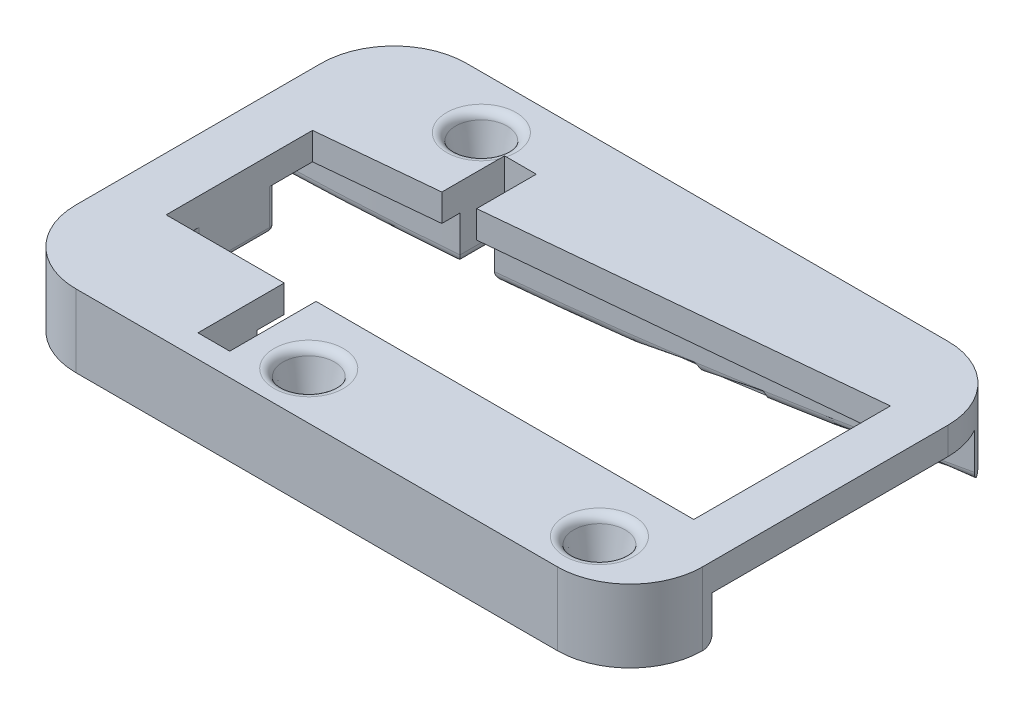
ISO-10303-21;
HEADER;
FILE_DESCRIPTION(('STEP AP214'),'2;1');
FILE_NAME('part.step','',(''),(''),'','','');
FILE_SCHEMA(('AUTOMOTIVE_DESIGN { 1 0 10303 214 1 1 1 1 }'));
ENDSEC;
DATA;
#1=APPLICATION_CONTEXT('core data for automotive mechanical design processes');
#2=APPLICATION_PROTOCOL_DEFINITION('international standard','automotive_design',2000,#1);
#3=PRODUCT_CONTEXT('',#1,'mechanical');
#4=PRODUCT('Part','Part','',(#3));
#5=PRODUCT_RELATED_PRODUCT_CATEGORY('part','',(#4));
#6=PRODUCT_DEFINITION_FORMATION('','',#4);
#7=PRODUCT_DEFINITION_CONTEXT('part definition',#1,'design');
#8=PRODUCT_DEFINITION('design','',#6,#7);
#9=PRODUCT_DEFINITION_SHAPE('','',#8);
#10=(LENGTH_UNIT() NAMED_UNIT(*) SI_UNIT(.MILLI.,.METRE.));
#11=(NAMED_UNIT(*) PLANE_ANGLE_UNIT() SI_UNIT($,.RADIAN.));
#12=(NAMED_UNIT(*) SI_UNIT($,.STERADIAN.) SOLID_ANGLE_UNIT());
#13=UNCERTAINTY_MEASURE_WITH_UNIT(LENGTH_MEASURE(1.E-05),#10,'distance_accuracy_value','');
#14=(GEOMETRIC_REPRESENTATION_CONTEXT(3) GLOBAL_UNCERTAINTY_ASSIGNED_CONTEXT((#13)) GLOBAL_UNIT_ASSIGNED_CONTEXT((#10,
#11,#12)) REPRESENTATION_CONTEXT('',''));
#15=CARTESIAN_POINT('',(0.,0.,0.));
#16=DIRECTION('',(0.,0.,1.));
#17=DIRECTION('',(1.,0.,0.));
#18=AXIS2_PLACEMENT_3D('',#15,#16,#17);
#19=CARTESIAN_POINT('',(4.11266827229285,5.,-388.138296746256));
#20=DIRECTION('',(0.,1.,0.));
#21=DIRECTION('',(0.,0.,1.));
#22=AXIS2_PLACEMENT_3D('',#19,#20,#21);
#23=PLANE('',#22);
#24=CARTESIAN_POINT('',(4.11266827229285,5.,-388.138296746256));
#25=DIRECTION('',(0.,1.,0.));
#26=DIRECTION('',(0.,0.,1.));
#27=AXIS2_PLACEMENT_3D('',#24,#25,#26);
#28=CIRCLE('',#27,353.);
#29=CARTESIAN_POINT('',(14.6003070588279,5.,-35.2941251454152));
#30=VERTEX_POINT('',#29);
#31=CARTESIAN_POINT('',(33.5127722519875,5.,-36.3647419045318));
#32=VERTEX_POINT('',#31);
#33=EDGE_CURVE('E436',#30,#32,#28,.T.);
#34=ORIENTED_EDGE('',*,*,#33,.T.);
#35=DIRECTION('',(0.,0.,-1.));
#36=VECTOR('',#35,1.);
#37=CARTESIAN_POINT('',(33.5127722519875,5.,-41.2715967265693));
#38=LINE('',#37,#36);
#39=CARTESIAN_POINT('',(33.5127722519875,5.,-34.3721348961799));
#40=VERTEX_POINT('',#39);
#41=EDGE_CURVE('E370',#40,#32,#38,.T.);
#42=ORIENTED_EDGE('',*,*,#41,.F.);
#43=DIRECTION('',(0.995489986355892,0.,-0.0948666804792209));
#44=VECTOR('',#43,1.);
#45=CARTESIAN_POINT('',(33.5127722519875,5.,-34.3721348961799));
#46=LINE('',#45,#44);
#47=CARTESIAN_POINT('',(20.5127722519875,5.,-33.1332808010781));
#48=VERTEX_POINT('',#47);
#49=EDGE_CURVE('E367',#48,#40,#46,.T.);
#50=ORIENTED_EDGE('',*,*,#49,.F.);
#51=DIRECTION('',(0.,0.,-1.));
#52=VECTOR('',#51,1.);
#53=CARTESIAN_POINT('',(20.5127722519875,5.,-17.0215967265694));
#54=LINE('',#53,#52);
#55=CARTESIAN_POINT('',(20.5127722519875,5.,-28.4215967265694));
#56=VERTEX_POINT('',#55);
#57=EDGE_CURVE('E364',#56,#48,#54,.T.);
#58=ORIENTED_EDGE('',*,*,#57,.F.);
#59=CARTESIAN_POINT('',(19.9127722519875,5.,-28.4215967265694));
#60=DIRECTION('',(0.,1.,0.));
#61=DIRECTION('',(0.,0.,1.));
#62=AXIS2_PLACEMENT_3D('',#59,#60,#61);
#63=CIRCLE('',#62,0.6);
#64=CARTESIAN_POINT('',(19.9127722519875,5.,-29.0215967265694));
#65=VERTEX_POINT('',#64);
#66=EDGE_CURVE('E956',#56,#65,#63,.T.);
#67=ORIENTED_EDGE('',*,*,#66,.T.);
#68=DIRECTION('',(1.,0.,0.));
#69=VECTOR('',#68,1.);
#70=CARTESIAN_POINT('',(18.0127722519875,5.,-29.0215967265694));
#71=LINE('',#70,#69);
#72=CARTESIAN_POINT('',(18.6127722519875,5.,-29.0215967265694));
#73=VERTEX_POINT('',#72);
#74=EDGE_CURVE('E401',#73,#65,#71,.T.);
#75=ORIENTED_EDGE('',*,*,#74,.F.);
#76=CARTESIAN_POINT('',(18.6127722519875,5.,-28.4215967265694));
#77=DIRECTION('',(0.,1.,0.));
#78=DIRECTION('',(0.,0.,1.));
#79=AXIS2_PLACEMENT_3D('',#76,#77,#78);
#80=CIRCLE('',#79,0.6);
#81=CARTESIAN_POINT('',(18.0127722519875,5.,-28.4215967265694));
#82=VERTEX_POINT('',#81);
#83=EDGE_CURVE('E958',#73,#82,#80,.T.);
#84=ORIENTED_EDGE('',*,*,#83,.T.);
#85=DIRECTION('',(0.,0.,-1.));
#86=VECTOR('',#85,1.);
#87=CARTESIAN_POINT('',(18.0127722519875,5.,-20.0215967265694));
#88=LINE('',#87,#86);
#89=CARTESIAN_POINT('',(18.0127722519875,5.,-20.6215967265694));
#90=VERTEX_POINT('',#89);
#91=EDGE_CURVE('E397',#90,#82,#88,.T.);
#92=ORIENTED_EDGE('',*,*,#91,.F.);
#93=CARTESIAN_POINT('',(18.6127722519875,5.,-20.6215967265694));
#94=DIRECTION('',(0.,1.,0.));
#95=DIRECTION('',(0.,0.,1.));
#96=AXIS2_PLACEMENT_3D('',#93,#94,#95);
#97=CIRCLE('',#96,0.6);
#98=CARTESIAN_POINT('',(18.6127722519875,5.,-20.0215967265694));
#99=VERTEX_POINT('',#98);
#100=EDGE_CURVE('E960',#90,#99,#97,.T.);
#101=ORIENTED_EDGE('',*,*,#100,.T.);
#102=DIRECTION('',(-1.,0.,0.));
#103=VECTOR('',#102,1.);
#104=CARTESIAN_POINT('',(18.0127722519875,5.,-20.0215967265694));
#105=LINE('',#104,#103);
#106=CARTESIAN_POINT('',(19.9127722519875,5.,-20.0215967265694));
#107=VERTEX_POINT('',#106);
#108=EDGE_CURVE('E394',#107,#99,#105,.T.);
#109=ORIENTED_EDGE('',*,*,#108,.F.);
#110=CARTESIAN_POINT('',(19.9127722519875,5.,-20.6215967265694));
#111=DIRECTION('',(0.,1.,0.));
#112=DIRECTION('',(0.,0.,1.));
#113=AXIS2_PLACEMENT_3D('',#110,#111,#112);
#114=CIRCLE('',#113,0.6);
#115=CARTESIAN_POINT('',(20.5127722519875,5.,-20.6215967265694));
#116=VERTEX_POINT('',#115);
#117=EDGE_CURVE('E962',#107,#116,#114,.T.);
#118=ORIENTED_EDGE('',*,*,#117,.T.);
#119=CARTESIAN_POINT('',(20.5127722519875,5.,-17.0215967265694));
#120=VERTEX_POINT('',#119);
#121=EDGE_CURVE('E365',#120,#116,#54,.T.);
#122=ORIENTED_EDGE('',*,*,#121,.F.);
#123=DIRECTION('',(-1.,0.,0.));
#124=VECTOR('',#123,1.);
#125=CARTESIAN_POINT('',(33.5127722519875,5.,-17.0215967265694));
#126=LINE('',#125,#124);
#127=CARTESIAN_POINT('',(33.5127722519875,5.,-17.0215967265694));
#128=VERTEX_POINT('',#127);
#129=EDGE_CURVE('E361',#128,#120,#126,.T.);
#130=ORIENTED_EDGE('',*,*,#129,.F.);
#131=DIRECTION('',(0.,0.,-1.));
#132=VECTOR('',#131,1.);
#133=CARTESIAN_POINT('',(33.5127722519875,5.,-7.52159672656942));
#134=LINE('',#133,#132);
#135=CARTESIAN_POINT('',(33.5127722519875,5.,-14.0215967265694));
#136=VERTEX_POINT('',#135);
#137=EDGE_CURVE('E356',#136,#128,#134,.T.);
#138=ORIENTED_EDGE('',*,*,#137,.F.);
#139=DIRECTION('',(-1.,0.,0.));
#140=VECTOR('',#139,1.);
#141=CARTESIAN_POINT('',(33.5127722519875,5.,-14.0215967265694));
#142=LINE('',#141,#140);
#143=CARTESIAN_POINT('',(14.6003070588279,5.,-14.0215967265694));
#144=VERTEX_POINT('',#143);
#145=EDGE_CURVE('E433',#136,#144,#142,.T.);
#146=ORIENTED_EDGE('',*,*,#145,.T.);
#147=DIRECTION('',(0.,0.,1.));
#148=VECTOR('',#147,1.);
#149=CARTESIAN_POINT('',(14.6003070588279,5.,-388.138296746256));
#150=LINE('',#149,#148);
#151=EDGE_CURVE('E410',#30,#144,#150,.T.);
#152=ORIENTED_EDGE('',*,*,#151,.F.);
#153=EDGE_LOOP('',(#34,#42,#50,#58,#67,#75,#84,#92,#101,#109,#118,#122,#130,#138,#146,#152));
#154=FACE_BOUND('',#153,.T.);
#155=ADVANCED_FACE('F39',(#154),#23,.F.);
#156=CARTESIAN_POINT('',(4.11266827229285,5.,-388.138296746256));
#157=DIRECTION('',(0.,1.,0.));
#158=DIRECTION('',(0.,0.,1.));
#159=AXIS2_PLACEMENT_3D('',#156,#157,#158);
#160=CIRCLE('',#159,353.);
#161=CARTESIAN_POINT('',(37.0127722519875,5.,-36.6748090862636));
#162=VERTEX_POINT('',#161);
#163=CARTESIAN_POINT('',(82.5497341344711,5.,-43.9630119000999));
#164=VERTEX_POINT('',#163);
#165=EDGE_CURVE('E423',#162,#164,#160,.T.);
#166=ORIENTED_EDGE('',*,*,#165,.T.);
#167=CARTESIAN_POINT('',(75.6003070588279,5.,-40.));
#168=DIRECTION('',(0.,1.,0.));
#169=DIRECTION('',(0.,0.,1.));
#170=AXIS2_PLACEMENT_3D('',#167,#168,#169);
#171=CIRCLE('',#170,8.);
#172=CARTESIAN_POINT('',(83.6003070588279,5.,-40.));
#173=VERTEX_POINT('',#172);
#174=EDGE_CURVE('E860',#164,#173,#171,.F.);
#175=ORIENTED_EDGE('',*,*,#174,.T.);
#176=DIRECTION('',(0.,0.,-1.));
#177=VECTOR('',#176,1.);
#178=CARTESIAN_POINT('',(83.6003070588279,5.,0.));
#179=LINE('',#178,#177);
#180=CARTESIAN_POINT('',(83.6003070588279,5.,-14.0215967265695));
#181=VERTEX_POINT('',#180);
#182=EDGE_CURVE('E474',#181,#173,#179,.T.);
#183=ORIENTED_EDGE('',*,*,#182,.F.);
#184=DIRECTION('',(1.,0.,0.));
#185=VECTOR('',#184,1.);
#186=CARTESIAN_POINT('',(37.0127722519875,5.,-14.0215967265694));
#187=LINE('',#186,#185);
#188=CARTESIAN_POINT('',(37.0127722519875,5.,-14.0215967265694));
#189=VERTEX_POINT('',#188);
#190=EDGE_CURVE('E430',#189,#181,#187,.T.);
#191=ORIENTED_EDGE('',*,*,#190,.F.);
#192=DIRECTION('',(0.,0.,1.));
#193=VECTOR('',#192,1.);
#194=CARTESIAN_POINT('',(37.0127722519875,5.,-7.52159672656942));
#195=LINE('',#194,#193);
#196=CARTESIAN_POINT('',(37.0127722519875,5.,-17.0215967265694));
#197=VERTEX_POINT('',#196);
#198=EDGE_CURVE('E354',#197,#189,#195,.T.);
#199=ORIENTED_EDGE('',*,*,#198,.F.);
#200=DIRECTION('',(-1.,0.,0.));
#201=VECTOR('',#200,1.);
#202=CARTESIAN_POINT('',(78.6003070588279,5.,-17.0215967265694));
#203=LINE('',#202,#201);
#204=CARTESIAN_POINT('',(78.6003070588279,5.,-17.0215967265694));
#205=VERTEX_POINT('',#204);
#206=EDGE_CURVE('E333',#205,#197,#203,.T.);
#207=ORIENTED_EDGE('',*,*,#206,.F.);
#208=DIRECTION('',(0.,0.,1.));
#209=VECTOR('',#208,1.);
#210=CARTESIAN_POINT('',(78.6003070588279,5.,-17.0215967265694));
#211=LINE('',#210,#209);
#212=CARTESIAN_POINT('',(78.6003070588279,5.,-38.6688177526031));
#213=VERTEX_POINT('',#212);
#214=EDGE_CURVE('E343',#213,#205,#211,.T.);
#215=ORIENTED_EDGE('',*,*,#214,.F.);
#216=DIRECTION('',(0.995489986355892,0.,-0.0948666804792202));
#217=VECTOR('',#216,1.);
#218=CARTESIAN_POINT('',(78.6003070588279,5.,-38.6688177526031));
#219=LINE('',#218,#217);
#220=CARTESIAN_POINT('',(37.0127722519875,5.,-34.7056725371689));
#221=VERTEX_POINT('',#220);
#222=EDGE_CURVE('E340',#221,#213,#219,.T.);
#223=ORIENTED_EDGE('',*,*,#222,.F.);
#224=DIRECTION('',(0.,0.,1.));
#225=VECTOR('',#224,1.);
#226=CARTESIAN_POINT('',(37.0127722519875,5.,-41.2715967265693));
#227=LINE('',#226,#225);
#228=EDGE_CURVE('E372',#162,#221,#227,.T.);
#229=ORIENTED_EDGE('',*,*,#228,.F.);
#230=EDGE_LOOP('',(#166,#175,#183,#191,#199,#207,#215,#223,#229));
#231=FACE_BOUND('',#230,.T.);
#232=ADVANCED_FACE('F352',(#231),#23,.F.);
#233=CARTESIAN_POINT('',(83.6003070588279,8.,0.));
#234=DIRECTION('',(-1.,0.,0.));
#235=DIRECTION('',(0.,0.,1.));
#236=AXIS2_PLACEMENT_3D('',#233,#234,#235);
#237=PLANE('',#236);
#238=ORIENTED_EDGE('',*,*,#182,.T.);
#239=DIRECTION('',(0.,-1.,0.));
#240=VECTOR('',#239,1.);
#241=CARTESIAN_POINT('',(83.6003070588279,8.,-40.));
#242=LINE('',#241,#240);
#243=CARTESIAN_POINT('',(83.6003070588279,8.,-40.));
#244=VERTEX_POINT('',#243);
#245=EDGE_CURVE('E857',#173,#244,#242,.F.);
#246=ORIENTED_EDGE('',*,*,#245,.T.);
#247=DIRECTION('',(0.,0.,-1.));
#248=VECTOR('',#247,1.);
#249=CARTESIAN_POINT('',(83.6003070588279,8.,0.));
#250=LINE('',#249,#248);
#251=CARTESIAN_POINT('',(83.6003070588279,8.,-13.));
#252=VERTEX_POINT('',#251);
#253=EDGE_CURVE('E467',#252,#244,#250,.T.);
#254=ORIENTED_EDGE('',*,*,#253,.F.);
#255=DIRECTION('',(0.,1.,0.));
#256=VECTOR('',#255,1.);
#257=CARTESIAN_POINT('',(83.6003070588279,0.,-13.));
#258=LINE('',#257,#256);
#259=CARTESIAN_POINT('',(83.6003070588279,0.,-13.));
#260=VERTEX_POINT('',#259);
#261=EDGE_CURVE('E841',#252,#260,#258,.F.);
#262=ORIENTED_EDGE('',*,*,#261,.T.);
#263=DIRECTION('',(0.,0.,-1.));
#264=VECTOR('',#263,1.);
#265=CARTESIAN_POINT('',(83.6003070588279,0.,0.));
#266=LINE('',#265,#264);
#267=CARTESIAN_POINT('',(83.6003070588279,0.,-13.0215967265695));
#268=VERTEX_POINT('',#267);
#269=EDGE_CURVE('E466',#260,#268,#266,.T.);
#270=ORIENTED_EDGE('',*,*,#269,.T.);
#271=CARTESIAN_POINT('',(83.6003070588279,1.,-13.0215967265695));
#272=DIRECTION('',(-1.,0.,0.));
#273=DIRECTION('',(0.,0.,1.));
#274=AXIS2_PLACEMENT_3D('',#271,#272,#273);
#275=CIRCLE('',#274,1.);
#276=CARTESIAN_POINT('',(83.6003070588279,1.,-14.0215967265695));
#277=VERTEX_POINT('',#276);
#278=EDGE_CURVE('E1042',#268,#277,#275,.F.);
#279=ORIENTED_EDGE('',*,*,#278,.T.);
#280=DIRECTION('',(0.,-1.,0.));
#281=VECTOR('',#280,1.);
#282=CARTESIAN_POINT('',(83.6003070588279,8.,-14.0215967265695));
#283=LINE('',#282,#281);
#284=EDGE_CURVE('E443',#181,#277,#283,.T.);
#285=ORIENTED_EDGE('',*,*,#284,.F.);
#286=EDGE_LOOP('',(#238,#246,#254,#262,#270,#279,#285));
#287=FACE_BOUND('',#286,.T.);
#288=ADVANCED_FACE('F743',(#287),#237,.F.);
#289=CARTESIAN_POINT('',(0.,0.,0.));
#290=DIRECTION('',(0.,-1.,0.));
#291=DIRECTION('',(0.,0.,-1.));
#292=AXIS2_PLACEMENT_3D('',#289,#290,#291);
#293=PLANE('',#292);
#294=CARTESIAN_POINT('',(75.0127722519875,0.,-10.2215967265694));
#295=DIRECTION('',(0.,-1.,0.));
#296=DIRECTION('',(0.,0.,1.));
#297=AXIS2_PLACEMENT_3D('',#294,#295,#296);
#298=CIRCLE('',#297,2.);
#299=CARTESIAN_POINT('',(75.0127722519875,0.,-8.22159672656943));
#300=VERTEX_POINT('',#299);
#301=EDGE_CURVE('E420',#300,#300,#298,.T.);
#302=ORIENTED_EDGE('',*,*,#301,.F.);
#303=EDGE_LOOP('',(#302));
#304=FACE_BOUND('',#303,.T.);
#305=CARTESIAN_POINT('',(43.0127722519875,0.,-10.2215967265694));
#306=DIRECTION('',(0.,-1.,0.));
#307=DIRECTION('',(0.,0.,1.));
#308=AXIS2_PLACEMENT_3D('',#305,#306,#307);
#309=CIRCLE('',#308,2.);
#310=CARTESIAN_POINT('',(43.0127722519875,0.,-8.22159672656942));
#311=VERTEX_POINT('',#310);
#312=EDGE_CURVE('E424',#311,#311,#309,.T.);
#313=ORIENTED_EDGE('',*,*,#312,.F.);
#314=EDGE_LOOP('',(#313));
#315=FACE_BOUND('',#314,.T.);
#316=ORIENTED_EDGE('',*,*,#269,.F.);
#317=CARTESIAN_POINT('',(75.6003070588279,0.,-13.));
#318=DIRECTION('',(0.,-1.,0.));
#319=DIRECTION('',(0.,0.,-1.));
#320=AXIS2_PLACEMENT_3D('',#317,#318,#319);
#321=CIRCLE('',#320,8.);
#322=CARTESIAN_POINT('',(75.6003070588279,0.,-5.));
#323=VERTEX_POINT('',#322);
#324=EDGE_CURVE('E834',#260,#323,#321,.T.);
#325=ORIENTED_EDGE('',*,*,#324,.T.);
#326=DIRECTION('',(-1.,0.,0.));
#327=VECTOR('',#326,1.);
#328=CARTESIAN_POINT('',(0.,0.,-4.99999999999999));
#329=LINE('',#328,#327);
#330=CARTESIAN_POINT('',(22.6003070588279,0.,-5.));
#331=VERTEX_POINT('',#330);
#332=EDGE_CURVE('E417',#323,#331,#329,.T.);
#333=ORIENTED_EDGE('',*,*,#332,.T.);
#334=CARTESIAN_POINT('',(22.6003070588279,0.,-13.));
#335=DIRECTION('',(0.,-1.,0.));
#336=DIRECTION('',(0.,0.,-1.));
#337=AXIS2_PLACEMENT_3D('',#334,#335,#336);
#338=CIRCLE('',#337,8.);
#339=CARTESIAN_POINT('',(14.6003070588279,0.,-13.));
#340=VERTEX_POINT('',#339);
#341=EDGE_CURVE('E54',#331,#340,#338,.T.);
#342=ORIENTED_EDGE('',*,*,#341,.T.);
#343=DIRECTION('',(0.,0.,-1.));
#344=VECTOR('',#343,1.);
#345=CARTESIAN_POINT('',(14.6003070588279,0.,0.));
#346=LINE('',#345,#344);
#347=CARTESIAN_POINT('',(14.6003070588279,0.,-13.0215967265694));
#348=VERTEX_POINT('',#347);
#349=EDGE_CURVE('E412',#340,#348,#346,.T.);
#350=ORIENTED_EDGE('',*,*,#349,.T.);
#351=DIRECTION('',(-1.,0.,0.));
#352=VECTOR('',#351,1.);
#353=CARTESIAN_POINT('',(33.5127722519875,0.,-13.0215967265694));
#354=LINE('',#353,#352);
#355=CARTESIAN_POINT('',(32.5127722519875,0.,-13.0215967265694));
#356=VERTEX_POINT('',#355);
#357=EDGE_CURVE('E521',#348,#356,#354,.F.);
#358=ORIENTED_EDGE('',*,*,#357,.T.);
#359=DIRECTION('',(0.,0.,-1.));
#360=VECTOR('',#359,1.);
#361=CARTESIAN_POINT('',(32.5127722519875,0.,-7.52159672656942));
#362=LINE('',#361,#360);
#363=CARTESIAN_POINT('',(32.5127722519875,0.,-6.52159672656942));
#364=VERTEX_POINT('',#363);
#365=EDGE_CURVE('E519',#356,#364,#362,.F.);
#366=ORIENTED_EDGE('',*,*,#365,.T.);
#367=DIRECTION('',(-1.,0.,0.));
#368=VECTOR('',#367,1.);
#369=CARTESIAN_POINT('',(37.0127722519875,0.,-6.52159672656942));
#370=LINE('',#369,#368);
#371=CARTESIAN_POINT('',(38.0127722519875,0.,-6.52159672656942));
#372=VERTEX_POINT('',#371);
#373=EDGE_CURVE('E517',#364,#372,#370,.F.);
#374=ORIENTED_EDGE('',*,*,#373,.T.);
#375=DIRECTION('',(0.,0.,1.));
#376=VECTOR('',#375,1.);
#377=CARTESIAN_POINT('',(38.0127722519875,0.,-14.0215967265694));
#378=LINE('',#377,#376);
#379=CARTESIAN_POINT('',(38.0127722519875,0.,-13.0215967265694));
#380=VERTEX_POINT('',#379);
#381=EDGE_CURVE('E515',#372,#380,#378,.F.);
#382=ORIENTED_EDGE('',*,*,#381,.T.);
#383=DIRECTION('',(1.,0.,0.));
#384=VECTOR('',#383,1.);
#385=CARTESIAN_POINT('',(0.,0.,-13.0215967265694));
#386=LINE('',#385,#384);
#387=EDGE_CURVE('E512',#380,#268,#386,.T.);
#388=ORIENTED_EDGE('',*,*,#387,.T.);
#389=EDGE_LOOP('',(#316,#325,#333,#342,#350,#358,#366,#374,#382,#388));
#390=FACE_BOUND('',#389,.T.);
#391=ADVANCED_FACE('F793',(#304,#315,#390),#293,.T.);
#392=CARTESIAN_POINT('',(30.0127722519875,0.,-42.2215967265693));
#393=DIRECTION('',(0.,-1.,0.));
#394=DIRECTION('',(0.,0.,1.));
#395=AXIS2_PLACEMENT_3D('',#392,#393,#394);
#396=CIRCLE('',#395,2.);
#397=CARTESIAN_POINT('',(30.0127722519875,0.,-40.2215967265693));
#398=VERTEX_POINT('',#397);
#399=EDGE_CURVE('E419',#398,#398,#396,.T.);
#400=ORIENTED_EDGE('',*,*,#399,.F.);
#401=EDGE_LOOP('',(#400));
#402=FACE_BOUND('',#401,.T.);
#403=DIRECTION('',(-1.,0.,0.));
#404=VECTOR('',#403,1.);
#405=CARTESIAN_POINT('',(13.6003070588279,0.,-48.));
#406=LINE('',#405,#404);
#407=CARTESIAN_POINT('',(75.6003070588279,0.,-48.));
#408=VERTEX_POINT('',#407);
#409=CARTESIAN_POINT('',(22.6003070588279,0.,-48.));
#410=VERTEX_POINT('',#409);
#411=EDGE_CURVE('E471',#408,#410,#406,.T.);
#412=ORIENTED_EDGE('',*,*,#411,.F.);
#413=CARTESIAN_POINT('',(75.6003070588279,0.,-40.));
#414=DIRECTION('',(0.,-1.,0.));
#415=DIRECTION('',(0.,0.,-1.));
#416=AXIS2_PLACEMENT_3D('',#413,#414,#415);
#417=CIRCLE('',#416,8.);
#418=CARTESIAN_POINT('',(81.9592311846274,0.,-44.8542851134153));
#419=VERTEX_POINT('',#418);
#420=EDGE_CURVE('E870',#408,#419,#417,.T.);
#421=ORIENTED_EDGE('',*,*,#420,.T.);
#422=CARTESIAN_POINT('',(4.11266827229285,0.,-388.138296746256));
#423=DIRECTION('',(0.,-1.,0.));
#424=DIRECTION('',(0.,0.,-1.));
#425=AXIS2_PLACEMENT_3D('',#422,#423,#424);
#426=CIRCLE('',#425,352.);
#427=CARTESIAN_POINT('',(38.0127722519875,0.,-37.7745101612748));
#428=VERTEX_POINT('',#427);
#429=EDGE_CURVE('E503',#419,#428,#426,.T.);
#430=ORIENTED_EDGE('',*,*,#429,.T.);
#431=DIRECTION('',(0.,0.,1.));
#432=VECTOR('',#431,1.);
#433=CARTESIAN_POINT('',(38.0127722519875,0.,-41.2715967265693));
#434=LINE('',#433,#432);
#435=CARTESIAN_POINT('',(38.0127722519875,0.,-42.2715967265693));
#436=VERTEX_POINT('',#435);
#437=EDGE_CURVE('E501',#428,#436,#434,.F.);
#438=ORIENTED_EDGE('',*,*,#437,.T.);
#439=DIRECTION('',(1.,0.,0.));
#440=VECTOR('',#439,1.);
#441=CARTESIAN_POINT('',(33.5127722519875,0.,-42.2715967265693));
#442=LINE('',#441,#440);
#443=CARTESIAN_POINT('',(32.5127722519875,0.,-42.2715967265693));
#444=VERTEX_POINT('',#443);
#445=EDGE_CURVE('E499',#436,#444,#442,.F.);
#446=ORIENTED_EDGE('',*,*,#445,.T.);
#447=DIRECTION('',(0.,0.,-1.));
#448=VECTOR('',#447,1.);
#449=CARTESIAN_POINT('',(32.5127722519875,0.,-36.3647419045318));
#450=LINE('',#449,#448);
#451=CARTESIAN_POINT('',(32.5127722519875,0.,-37.2858575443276));
#452=VERTEX_POINT('',#451);
#453=EDGE_CURVE('E497',#444,#452,#450,.F.);
#454=ORIENTED_EDGE('',*,*,#453,.T.);
#455=CARTESIAN_POINT('',(4.11266827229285,0.,-388.138296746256));
#456=DIRECTION('',(0.,-1.,0.));
#457=DIRECTION('',(0.,0.,-1.));
#458=AXIS2_PLACEMENT_3D('',#455,#456,#457);
#459=CIRCLE('',#458,352.);
#460=CARTESIAN_POINT('',(14.6003070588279,0.,-36.2945680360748));
#461=VERTEX_POINT('',#460);
#462=EDGE_CURVE('E495',#452,#461,#459,.T.);
#463=ORIENTED_EDGE('',*,*,#462,.T.);
#464=CARTESIAN_POINT('',(14.6003070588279,0.,-40.));
#465=VERTEX_POINT('',#464);
#466=EDGE_CURVE('E415',#461,#465,#346,.T.);
#467=ORIENTED_EDGE('',*,*,#466,.T.);
#468=CARTESIAN_POINT('',(22.6003070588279,0.,-40.));
#469=DIRECTION('',(0.,-1.,0.));
#470=DIRECTION('',(0.,0.,-1.));
#471=AXIS2_PLACEMENT_3D('',#468,#469,#470);
#472=CIRCLE('',#471,8.);
#473=EDGE_CURVE('E872',#465,#410,#472,.T.);
#474=ORIENTED_EDGE('',*,*,#473,.T.);
#475=EDGE_LOOP('',(#412,#421,#430,#438,#446,#454,#463,#467,#474));
#476=FACE_BOUND('',#475,.T.);
#477=ADVANCED_FACE('F796',(#402,#476),#293,.T.);
#478=CARTESIAN_POINT('',(13.6003070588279,8.,-48.));
#479=DIRECTION('',(0.,0.,1.));
#480=DIRECTION('',(1.,0.,0.));
#481=AXIS2_PLACEMENT_3D('',#478,#479,#480);
#482=PLANE('',#481);
#483=DIRECTION('',(-1.,0.,0.));
#484=VECTOR('',#483,1.);
#485=CARTESIAN_POINT('',(13.6003070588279,8.,-48.));
#486=LINE('',#485,#484);
#487=CARTESIAN_POINT('',(75.6003070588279,8.,-48.));
#488=VERTEX_POINT('',#487);
#489=CARTESIAN_POINT('',(22.6003070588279,8.,-48.));
#490=VERTEX_POINT('',#489);
#491=EDGE_CURVE('E470',#488,#490,#486,.T.);
#492=ORIENTED_EDGE('',*,*,#491,.F.);
#493=DIRECTION('',(0.,-1.,0.));
#494=VECTOR('',#493,1.);
#495=CARTESIAN_POINT('',(75.6003070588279,8.,-48.));
#496=LINE('',#495,#494);
#497=EDGE_CURVE('E873',#488,#408,#496,.T.);
#498=ORIENTED_EDGE('',*,*,#497,.T.);
#499=ORIENTED_EDGE('',*,*,#411,.T.);
#500=DIRECTION('',(0.,1.,0.));
#501=VECTOR('',#500,1.);
#502=CARTESIAN_POINT('',(22.6003070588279,8.,-48.));
#503=LINE('',#502,#501);
#504=EDGE_CURVE('E687',#410,#490,#503,.T.);
#505=ORIENTED_EDGE('',*,*,#504,.T.);
#506=EDGE_LOOP('',(#492,#498,#499,#505));
#507=FACE_BOUND('',#506,.T.);
#508=ADVANCED_FACE('F791',(#507),#482,.F.);
#509=CARTESIAN_POINT('',(0.,8.,0.));
#510=DIRECTION('',(0.,-1.,0.));
#511=DIRECTION('',(0.,0.,-1.));
#512=AXIS2_PLACEMENT_3D('',#509,#510,#511);
#513=PLANE('',#512);
#514=CARTESIAN_POINT('',(30.0127722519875,8.,-42.2215967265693));
#515=DIRECTION('',(0.,-1.,0.));
#516=DIRECTION('',(0.,0.,-1.));
#517=AXIS2_PLACEMENT_3D('',#514,#515,#516);
#518=CIRCLE('',#517,3.81980390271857);
#519=CARTESIAN_POINT('',(33.5127722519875,8.,-40.6915961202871));
#520=VERTEX_POINT('',#519);
#521=CARTESIAN_POINT('',(33.712556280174,8.,-41.2715967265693));
#522=VERTEX_POINT('',#521);
#523=EDGE_CURVE('E965',#520,#522,#518,.T.);
#524=ORIENTED_EDGE('',*,*,#523,.T.);
#525=DIRECTION('',(-1.,0.,0.));
#526=VECTOR('',#525,1.);
#527=CARTESIAN_POINT('',(33.5127722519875,7.99999999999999,-41.2715967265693));
#528=LINE('',#527,#526);
#529=CARTESIAN_POINT('',(37.0127722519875,7.99999999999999,-41.2715967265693));
#530=VERTEX_POINT('',#529);
#531=EDGE_CURVE('E1025',#530,#522,#528,.T.);
#532=ORIENTED_EDGE('',*,*,#531,.F.);
#533=DIRECTION('',(0.,0.,-1.));
#534=VECTOR('',#533,1.);
#535=CARTESIAN_POINT('',(37.0127722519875,7.99999999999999,-41.2715967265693));
#536=LINE('',#535,#534);
#537=CARTESIAN_POINT('',(37.0127722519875,7.99999999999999,-34.7056725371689));
#538=VERTEX_POINT('',#537);
#539=EDGE_CURVE('E1030',#538,#530,#536,.T.);
#540=ORIENTED_EDGE('',*,*,#539,.F.);
#541=DIRECTION('',(-0.995489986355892,0.,0.0948666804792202));
#542=VECTOR('',#541,1.);
#543=CARTESIAN_POINT('',(78.6003070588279,7.99999999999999,-38.6688177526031));
#544=LINE('',#543,#542);
#545=CARTESIAN_POINT('',(78.6003070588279,7.99999999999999,-38.6688177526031));
#546=VERTEX_POINT('',#545);
#547=EDGE_CURVE('E1032',#546,#538,#544,.T.);
#548=ORIENTED_EDGE('',*,*,#547,.F.);
#549=DIRECTION('',(0.,0.,-1.));
#550=VECTOR('',#549,1.);
#551=CARTESIAN_POINT('',(78.6003070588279,7.99999999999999,-17.0215967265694));
#552=LINE('',#551,#550);
#553=CARTESIAN_POINT('',(78.6003070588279,7.99999999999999,-17.0215967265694));
#554=VERTEX_POINT('',#553);
#555=EDGE_CURVE('E393',#554,#546,#552,.T.);
#556=ORIENTED_EDGE('',*,*,#555,.F.);
#557=DIRECTION('',(1.,0.,0.));
#558=VECTOR('',#557,1.);
#559=CARTESIAN_POINT('',(78.6003070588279,7.99999999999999,-17.0215967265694));
#560=LINE('',#559,#558);
#561=CARTESIAN_POINT('',(37.0127722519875,7.99999999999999,-17.0215967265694));
#562=VERTEX_POINT('',#561);
#563=EDGE_CURVE('E336',#562,#554,#560,.T.);
#564=ORIENTED_EDGE('',*,*,#563,.F.);
#565=DIRECTION('',(0.,0.,-1.));
#566=VECTOR('',#565,1.);
#567=CARTESIAN_POINT('',(37.0127722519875,7.99999999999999,-7.52159672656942));
#568=LINE('',#567,#566);
#569=CARTESIAN_POINT('',(37.0127722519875,7.99999999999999,-7.52159672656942));
#570=VERTEX_POINT('',#569);
#571=EDGE_CURVE('E376',#570,#562,#568,.T.);
#572=ORIENTED_EDGE('',*,*,#571,.F.);
#573=DIRECTION('',(1.,0.,0.));
#574=VECTOR('',#573,1.);
#575=CARTESIAN_POINT('',(37.0127722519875,7.99999999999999,-7.52159672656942));
#576=LINE('',#575,#574);
#577=CARTESIAN_POINT('',(33.5127722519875,7.99999999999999,-7.52159672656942));
#578=VERTEX_POINT('',#577);
#579=EDGE_CURVE('E1093',#578,#570,#576,.T.);
#580=ORIENTED_EDGE('',*,*,#579,.F.);
#581=DIRECTION('',(0.,0.,1.));
#582=VECTOR('',#581,1.);
#583=CARTESIAN_POINT('',(33.5127722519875,7.99999999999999,-7.52159672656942));
#584=LINE('',#583,#582);
#585=CARTESIAN_POINT('',(33.5127722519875,7.99999999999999,-17.0215967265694));
#586=VERTEX_POINT('',#585);
#587=EDGE_CURVE('E1090',#586,#578,#584,.T.);
#588=ORIENTED_EDGE('',*,*,#587,.F.);
#589=DIRECTION('',(1.,0.,0.));
#590=VECTOR('',#589,1.);
#591=CARTESIAN_POINT('',(33.5127722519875,7.99999999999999,-17.0215967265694));
#592=LINE('',#591,#590);
#593=CARTESIAN_POINT('',(20.5127722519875,7.99999999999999,-17.0215967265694));
#594=VERTEX_POINT('',#593);
#595=EDGE_CURVE('E1088',#594,#586,#592,.T.);
#596=ORIENTED_EDGE('',*,*,#595,.F.);
#597=DIRECTION('',(0.,0.,1.));
#598=VECTOR('',#597,1.);
#599=CARTESIAN_POINT('',(20.5127722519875,7.99999999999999,-17.0215967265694));
#600=LINE('',#599,#598);
#601=CARTESIAN_POINT('',(20.5127722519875,7.99999999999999,-33.1332808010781));
#602=VERTEX_POINT('',#601);
#603=EDGE_CURVE('E1089',#602,#594,#600,.T.);
#604=ORIENTED_EDGE('',*,*,#603,.F.);
#605=DIRECTION('',(-0.995489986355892,0.,0.0948666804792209));
#606=VECTOR('',#605,1.);
#607=CARTESIAN_POINT('',(33.5127722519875,7.99999999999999,-34.3721348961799));
#608=LINE('',#607,#606);
#609=CARTESIAN_POINT('',(33.5127722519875,7.99999999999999,-34.3721348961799));
#610=VERTEX_POINT('',#609);
#611=EDGE_CURVE('E1024',#610,#602,#608,.T.);
#612=ORIENTED_EDGE('',*,*,#611,.F.);
#613=DIRECTION('',(0.,0.,1.));
#614=VECTOR('',#613,1.);
#615=CARTESIAN_POINT('',(33.5127722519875,7.99999999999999,-41.2715967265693));
#616=LINE('',#615,#614);
#617=EDGE_CURVE('E1016',#520,#610,#616,.T.);
#618=ORIENTED_EDGE('',*,*,#617,.F.);
#619=EDGE_LOOP('',(#524,#532,#540,#548,#556,#564,#572,#580,#588,#596,#604,#612,#618));
#620=FACE_BOUND('',#619,.T.);
#621=CARTESIAN_POINT('',(75.0127722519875,8.,-10.2215967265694));
#622=DIRECTION('',(0.,-1.,0.));
#623=DIRECTION('',(0.,0.,-1.));
#624=AXIS2_PLACEMENT_3D('',#621,#622,#623);
#625=CIRCLE('',#624,3.81980390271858);
#626=CARTESIAN_POINT('',(75.0127722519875,8.,-14.041400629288));
#627=VERTEX_POINT('',#626);
#628=EDGE_CURVE('E1005',#627,#627,#625,.T.);
#629=ORIENTED_EDGE('',*,*,#628,.T.);
#630=EDGE_LOOP('',(#629));
#631=FACE_BOUND('',#630,.T.);
#632=CARTESIAN_POINT('',(43.0127722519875,8.,-10.2215967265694));
#633=DIRECTION('',(0.,-1.,0.));
#634=DIRECTION('',(0.,0.,-1.));
#635=AXIS2_PLACEMENT_3D('',#632,#633,#634);
#636=CIRCLE('',#635,3.81980390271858);
#637=CARTESIAN_POINT('',(43.0127722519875,8.,-14.041400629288));
#638=VERTEX_POINT('',#637);
#639=EDGE_CURVE('E1002',#638,#638,#636,.T.);
#640=ORIENTED_EDGE('',*,*,#639,.T.);
#641=EDGE_LOOP('',(#640));
#642=FACE_BOUND('',#641,.T.);
#643=ORIENTED_EDGE('',*,*,#253,.T.);
#644=CARTESIAN_POINT('',(75.6003070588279,8.,-40.));
#645=DIRECTION('',(0.,-1.,0.));
#646=DIRECTION('',(0.,0.,-1.));
#647=AXIS2_PLACEMENT_3D('',#644,#645,#646);
#648=CIRCLE('',#647,8.);
#649=EDGE_CURVE('E849',#244,#488,#648,.F.);
#650=ORIENTED_EDGE('',*,*,#649,.T.);
#651=ORIENTED_EDGE('',*,*,#491,.T.);
#652=CARTESIAN_POINT('',(22.6003070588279,8.,-40.));
#653=DIRECTION('',(0.,-1.,0.));
#654=DIRECTION('',(0.,0.,-1.));
#655=AXIS2_PLACEMENT_3D('',#652,#653,#654);
#656=CIRCLE('',#655,8.);
#657=CARTESIAN_POINT('',(14.6003070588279,8.,-40.));
#658=VERTEX_POINT('',#657);
#659=EDGE_CURVE('E855',#490,#658,#656,.F.);
#660=ORIENTED_EDGE('',*,*,#659,.T.);
#661=DIRECTION('',(0.,0.,1.));
#662=VECTOR('',#661,1.);
#663=CARTESIAN_POINT('',(14.6003070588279,8.,-48.));
#664=LINE('',#663,#662);
#665=CARTESIAN_POINT('',(14.6003070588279,8.,-13.));
#666=VERTEX_POINT('',#665);
#667=EDGE_CURVE('E404',#658,#666,#664,.T.);
#668=ORIENTED_EDGE('',*,*,#667,.T.);
#669=CARTESIAN_POINT('',(22.6003070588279,8.,-13.));
#670=DIRECTION('',(0.,-1.,0.));
#671=DIRECTION('',(0.,0.,-1.));
#672=AXIS2_PLACEMENT_3D('',#669,#670,#671);
#673=CIRCLE('',#672,8.);
#674=CARTESIAN_POINT('',(22.6003070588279,8.,-5.));
#675=VERTEX_POINT('',#674);
#676=EDGE_CURVE('E853',#666,#675,#673,.F.);
#677=ORIENTED_EDGE('',*,*,#676,.T.);
#678=DIRECTION('',(1.,0.,0.));
#679=VECTOR('',#678,1.);
#680=CARTESIAN_POINT('',(83.6003070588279,8.,-5.));
#681=LINE('',#680,#679);
#682=CARTESIAN_POINT('',(75.6003070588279,8.,-5.));
#683=VERTEX_POINT('',#682);
#684=EDGE_CURVE('E407',#675,#683,#681,.T.);
#685=ORIENTED_EDGE('',*,*,#684,.T.);
#686=CARTESIAN_POINT('',(75.6003070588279,8.,-13.));
#687=DIRECTION('',(0.,-1.,0.));
#688=DIRECTION('',(0.,0.,-1.));
#689=AXIS2_PLACEMENT_3D('',#686,#687,#688);
#690=CIRCLE('',#689,8.);
#691=EDGE_CURVE('E851',#683,#252,#690,.F.);
#692=ORIENTED_EDGE('',*,*,#691,.T.);
#693=EDGE_LOOP('',(#643,#650,#651,#660,#668,#677,#685,#692));
#694=FACE_BOUND('',#693,.T.);
#695=ADVANCED_FACE('F752',(#620,#631,#642,#694),#513,.F.);
#696=CARTESIAN_POINT('',(4.11266827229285,5.,-388.138296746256));
#697=DIRECTION('',(0.,-1.,0.));
#698=DIRECTION('',(0.,0.,-1.));
#699=AXIS2_PLACEMENT_3D('',#696,#697,#698);
#700=CYLINDRICAL_SURFACE('',#699,353.);
#701=DIRECTION('',(0.,-1.,0.));
#702=VECTOR('',#701,1.);
#703=CARTESIAN_POINT('',(14.6003070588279,5.,-35.2941251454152));
#704=LINE('',#703,#702);
#705=CARTESIAN_POINT('',(14.6003070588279,1.,-35.2941251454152));
#706=VERTEX_POINT('',#705);
#707=EDGE_CURVE('E414',#706,#30,#704,.F.);
#708=ORIENTED_EDGE('',*,*,#707,.F.);
#709=CARTESIAN_POINT('',(4.11266827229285,1.,-388.138296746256));
#710=DIRECTION('',(0.,-1.,0.));
#711=DIRECTION('',(0.,0.,-1.));
#712=AXIS2_PLACEMENT_3D('',#709,#710,#711);
#713=CIRCLE('',#712,353.);
#714=CARTESIAN_POINT('',(33.5127722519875,1.,-36.3647419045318));
#715=VERTEX_POINT('',#714);
#716=EDGE_CURVE('E924',#706,#715,#713,.F.);
#717=ORIENTED_EDGE('',*,*,#716,.T.);
#718=DIRECTION('',(0.,-1.,0.));
#719=VECTOR('',#718,1.);
#720=CARTESIAN_POINT('',(33.5127722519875,5.,-36.3647419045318));
#721=LINE('',#720,#719);
#722=EDGE_CURVE('E440',#32,#715,#721,.T.);
#723=ORIENTED_EDGE('',*,*,#722,.F.);
#724=ORIENTED_EDGE('',*,*,#33,.F.);
#725=EDGE_LOOP('',(#708,#717,#723,#724));
#726=FACE_BOUND('',#725,.T.);
#727=ADVANCED_FACE('F748',(#726),#700,.T.);
#728=CARTESIAN_POINT('',(33.5127722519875,5.,-14.0215967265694));
#729=DIRECTION('',(0.,0.,1.));
#730=DIRECTION('',(1.,0.,0.));
#731=AXIS2_PLACEMENT_3D('',#728,#729,#730);
#732=PLANE('',#731);
#733=DIRECTION('',(0.,-1.,0.));
#734=VECTOR('',#733,1.);
#735=CARTESIAN_POINT('',(33.5127722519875,5.,-14.0215967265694));
#736=LINE('',#735,#734);
#737=CARTESIAN_POINT('',(33.5127722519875,1.,-14.0215967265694));
#738=VERTEX_POINT('',#737);
#739=EDGE_CURVE('E444',#136,#738,#736,.T.);
#740=ORIENTED_EDGE('',*,*,#739,.T.);
#741=DIRECTION('',(-1.,0.,0.));
#742=VECTOR('',#741,1.);
#743=CARTESIAN_POINT('',(14.6003070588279,1.,-14.0215967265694));
#744=LINE('',#743,#742);
#745=CARTESIAN_POINT('',(14.6003070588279,1.,-14.0215967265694));
#746=VERTEX_POINT('',#745);
#747=EDGE_CURVE('E527',#738,#746,#744,.T.);
#748=ORIENTED_EDGE('',*,*,#747,.T.);
#749=DIRECTION('',(0.,-1.,0.));
#750=VECTOR('',#749,1.);
#751=CARTESIAN_POINT('',(14.6003070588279,5.,-14.0215967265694));
#752=LINE('',#751,#750);
#753=EDGE_CURVE('E480',#144,#746,#752,.T.);
#754=ORIENTED_EDGE('',*,*,#753,.F.);
#755=ORIENTED_EDGE('',*,*,#145,.F.);
#756=EDGE_LOOP('',(#740,#748,#754,#755));
#757=FACE_BOUND('',#756,.T.);
#758=ADVANCED_FACE('F751',(#757),#732,.F.);
#759=CARTESIAN_POINT('',(37.0127722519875,5.,-14.0215967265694));
#760=DIRECTION('',(0.,0.,-1.));
#761=DIRECTION('',(-1.,0.,0.));
#762=AXIS2_PLACEMENT_3D('',#759,#760,#761);
#763=PLANE('',#762);
#764=ORIENTED_EDGE('',*,*,#284,.T.);
#765=DIRECTION('',(1.,0.,0.));
#766=VECTOR('',#765,1.);
#767=CARTESIAN_POINT('',(37.0127722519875,1.,-14.0215967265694));
#768=LINE('',#767,#766);
#769=CARTESIAN_POINT('',(37.0127722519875,1.,-14.0215967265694));
#770=VERTEX_POINT('',#769);
#771=EDGE_CURVE('E1045',#277,#770,#768,.F.);
#772=ORIENTED_EDGE('',*,*,#771,.T.);
#773=DIRECTION('',(0.,-1.,0.));
#774=VECTOR('',#773,1.);
#775=CARTESIAN_POINT('',(37.0127722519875,5.,-14.0215967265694));
#776=LINE('',#775,#774);
#777=EDGE_CURVE('E453',#189,#770,#776,.T.);
#778=ORIENTED_EDGE('',*,*,#777,.F.);
#779=ORIENTED_EDGE('',*,*,#190,.T.);
#780=EDGE_LOOP('',(#764,#772,#778,#779));
#781=FACE_BOUND('',#780,.T.);
#782=ADVANCED_FACE('F756',(#781),#763,.T.);
#783=CARTESIAN_POINT('',(4.11266827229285,5.,-388.138296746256));
#784=DIRECTION('',(0.,-1.,0.));
#785=DIRECTION('',(0.,0.,-1.));
#786=AXIS2_PLACEMENT_3D('',#783,#784,#785);
#787=CYLINDRICAL_SURFACE('',#786,353.);
#788=CARTESIAN_POINT('',(4.11266827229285,1.,-388.138296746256));
#789=DIRECTION('',(0.,-1.,0.));
#790=DIRECTION('',(0.,0.,-1.));
#791=AXIS2_PLACEMENT_3D('',#788,#789,#790);
#792=CIRCLE('',#791,353.);
#793=CARTESIAN_POINT('',(37.0127722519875,1.,-36.6748090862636));
#794=VERTEX_POINT('',#793);
#795=CARTESIAN_POINT('',(82.54973413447,1.,-43.9630119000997));
#796=VERTEX_POINT('',#795);
#797=EDGE_CURVE('E898',#794,#796,#792,.F.);
#798=ORIENTED_EDGE('',*,*,#797,.T.);
#799=DIRECTION('',(0.,-1.,0.));
#800=VECTOR('',#799,1.);
#801=CARTESIAN_POINT('',(82.54973413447,1.,-43.9630119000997));
#802=LINE('',#801,#800);
#803=EDGE_CURVE('E862',#796,#164,#802,.F.);
#804=ORIENTED_EDGE('',*,*,#803,.T.);
#805=ORIENTED_EDGE('',*,*,#165,.F.);
#806=DIRECTION('',(0.,-1.,0.));
#807=VECTOR('',#806,1.);
#808=CARTESIAN_POINT('',(37.0127722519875,5.,-36.6748090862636));
#809=LINE('',#808,#807);
#810=EDGE_CURVE('E456',#162,#794,#809,.T.);
#811=ORIENTED_EDGE('',*,*,#810,.T.);
#812=EDGE_LOOP('',(#798,#804,#805,#811));
#813=FACE_BOUND('',#812,.T.);
#814=ADVANCED_FACE('F774',(#813),#787,.T.);
#815=CARTESIAN_POINT('',(33.5127722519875,5.,-36.3647419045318));
#816=DIRECTION('',(-1.,0.,0.));
#817=DIRECTION('',(0.,0.,1.));
#818=AXIS2_PLACEMENT_3D('',#815,#816,#817);
#819=PLANE('',#818);
#820=ORIENTED_EDGE('',*,*,#722,.T.);
#821=DIRECTION('',(0.,0.,-1.));
#822=VECTOR('',#821,1.);
#823=CARTESIAN_POINT('',(33.5127722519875,1.,-41.2715967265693));
#824=LINE('',#823,#822);
#825=CARTESIAN_POINT('',(33.5127722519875,1.,-41.2715967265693));
#826=VERTEX_POINT('',#825);
#827=EDGE_CURVE('E492',#715,#826,#824,.T.);
#828=ORIENTED_EDGE('',*,*,#827,.T.);
#829=DIRECTION('',(0.,-1.,0.));
#830=VECTOR('',#829,1.);
#831=CARTESIAN_POINT('',(33.5127722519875,5.,-41.2715967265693));
#832=LINE('',#831,#830);
#833=CARTESIAN_POINT('',(33.5127722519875,7.98116602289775,-41.2715967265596));
#834=VERTEX_POINT('',#833);
#835=EDGE_CURVE('E439',#834,#826,#832,.T.);
#836=ORIENTED_EDGE('',*,*,#835,.F.);
#837=CARTESIAN_POINT('',(33.5127722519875,7.97400457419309,-44.2520657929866));
#838=CARTESIAN_POINT('',(33.5127722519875,7.98377628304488,-44.1680202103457));
#839=CARTESIAN_POINT('',(33.5127722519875,7.99031541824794,-44.0837041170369));
#840=CARTESIAN_POINT('',(33.5127722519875,7.99845948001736,-43.9149718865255));
#841=CARTESIAN_POINT('',(33.5127722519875,8.00007331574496,-43.8305562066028));
#842=CARTESIAN_POINT('',(33.5127722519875,7.99992200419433,-43.6618182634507));
#843=CARTESIAN_POINT('',(33.5127722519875,7.99815921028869,-43.5774959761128));
#844=CARTESIAN_POINT('',(33.5127722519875,7.99260950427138,-43.4088836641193));
#845=CARTESIAN_POINT('',(33.5127722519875,7.98882160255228,-43.3245936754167));
#846=CARTESIAN_POINT('',(33.5127722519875,7.98049703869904,-43.1565681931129));
#847=CARTESIAN_POINT('',(33.5127722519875,7.97596506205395,-43.072832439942));
#848=CARTESIAN_POINT('',(33.5127722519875,7.96722836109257,-42.9053440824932));
#849=CARTESIAN_POINT('',(33.5127722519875,7.96302362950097,-42.8215914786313));
#850=CARTESIAN_POINT('',(33.5127722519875,7.9558440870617,-42.6541228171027));
#851=CARTESIAN_POINT('',(33.5127722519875,7.95286791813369,-42.5704068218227));
#852=CARTESIAN_POINT('',(33.5127722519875,7.94874808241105,-42.4029267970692));
#853=CARTESIAN_POINT('',(33.5127722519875,7.94760440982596,-42.3191627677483));
#854=CARTESIAN_POINT('',(33.5127722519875,7.947381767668,-42.1518600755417));
#855=CARTESIAN_POINT('',(33.5127722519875,7.94829717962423,-42.0683214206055));
#856=CARTESIAN_POINT('',(33.5127722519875,7.95199642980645,-41.90128562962));
#857=CARTESIAN_POINT('',(33.5127722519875,7.95478033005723,-41.817788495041));
#858=CARTESIAN_POINT('',(33.5127722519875,7.96165808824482,-41.650677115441));
#859=CARTESIAN_POINT('',(33.5127722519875,7.96575467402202,-41.5670629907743));
#860=CARTESIAN_POINT('',(33.5127722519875,7.97439015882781,-41.3998595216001));
#861=CARTESIAN_POINT('',(33.5127722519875,7.97892905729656,-41.3162701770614));
#862=CARTESIAN_POINT('',(33.5127722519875,7.98736056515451,-41.1494606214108));
#863=CARTESIAN_POINT('',(33.5127722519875,7.99125618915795,-41.0662405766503));
#864=CARTESIAN_POINT('',(33.5127722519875,7.99723968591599,-40.8997379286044));
#865=CARTESIAN_POINT('',(33.5127722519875,7.99932779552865,-40.8164553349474));
#866=CARTESIAN_POINT('',(33.5127722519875,8.00040006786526,-40.6500615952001));
#867=CARTESIAN_POINT('',(33.5127722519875,7.99939203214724,-40.566950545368));
#868=CARTESIAN_POINT('',(33.5127722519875,7.99288189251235,-40.4009177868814));
#869=CARTESIAN_POINT('',(33.5127722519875,7.98738161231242,-40.3179960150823));
#870=CARTESIAN_POINT('',(33.5127722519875,7.96786915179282,-40.1286994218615));
#871=CARTESIAN_POINT('',(33.5127722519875,7.95184814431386,-40.0225106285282));
#872=CARTESIAN_POINT('',(33.5127722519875,7.90595273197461,-39.81320260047));
#873=CARTESIAN_POINT('',(33.5127722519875,7.87611835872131,-39.7100754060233));
#874=CARTESIAN_POINT('',(33.5127722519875,7.81192156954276,-39.5457445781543));
#875=CARTESIAN_POINT('',(33.5127722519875,7.78280925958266,-39.4825133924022));
#876=CARTESIAN_POINT('',(33.5127722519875,7.7156281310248,-39.3608733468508));
#877=CARTESIAN_POINT('',(33.5127722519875,7.67756387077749,-39.3024620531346));
#878=CARTESIAN_POINT('',(33.5127722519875,7.6020884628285,-39.2067558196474));
#879=CARTESIAN_POINT('',(33.5127722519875,7.56680378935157,-39.1677942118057));
#880=CARTESIAN_POINT('',(33.5127722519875,7.49047453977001,-39.0959824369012));
#881=CARTESIAN_POINT('',(33.5127722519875,7.4494393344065,-39.063122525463));
#882=CARTESIAN_POINT('',(33.5127722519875,7.37012276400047,-39.010827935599));
#883=CARTESIAN_POINT('',(33.5127722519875,7.33274173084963,-38.9900336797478));
#884=CARTESIAN_POINT('',(33.5127722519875,7.2550293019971,-38.9549198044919));
#885=CARTESIAN_POINT('',(33.5127722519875,7.21469922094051,-38.9405973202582));
#886=CARTESIAN_POINT('',(33.5127722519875,7.13188596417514,-38.91931577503));
#887=CARTESIAN_POINT('',(33.5127722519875,7.08939245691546,-38.9123963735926));
#888=CARTESIAN_POINT('',(33.5127722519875,7.00385995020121,-38.9065908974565));
#889=CARTESIAN_POINT('',(33.5127722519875,6.96082111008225,-38.9077025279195));
#890=CARTESIAN_POINT('',(33.5127722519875,6.8795321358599,-38.9174014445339));
#891=CARTESIAN_POINT('',(33.5127722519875,6.84119837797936,-38.9253101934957));
#892=CARTESIAN_POINT('',(33.5127722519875,6.76632573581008,-38.9472034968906));
#893=CARTESIAN_POINT('',(33.5127722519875,6.72978685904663,-38.961188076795));
#894=CARTESIAN_POINT('',(33.5127722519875,6.65777907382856,-38.9951724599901));
#895=CARTESIAN_POINT('',(33.5127722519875,6.62241761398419,-39.0153979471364));
#896=CARTESIAN_POINT('',(33.5127722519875,6.55492852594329,-39.0606542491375));
#897=CARTESIAN_POINT('',(33.5127722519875,6.52280328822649,-39.0856885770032));
#898=CARTESIAN_POINT('',(33.5127722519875,6.44622942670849,-39.1536237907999));
#899=CARTESIAN_POINT('',(33.5127722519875,6.40402405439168,-39.1990596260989));
#900=CARTESIAN_POINT('',(33.5127722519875,6.32744220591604,-39.296059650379));
#901=CARTESIAN_POINT('',(33.5127722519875,6.29308021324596,-39.3476349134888));
#902=CARTESIAN_POINT('',(33.5127722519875,6.21556968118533,-39.482619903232));
#903=CARTESIAN_POINT('',(33.5127722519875,6.1770706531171,-39.5686964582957));
#904=CARTESIAN_POINT('',(33.5127722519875,6.12946996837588,-39.7012539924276));
#905=CARTESIAN_POINT('',(33.5127722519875,6.115281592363,-39.7460791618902));
#906=CARTESIAN_POINT('',(33.5127722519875,6.08991098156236,-39.8365618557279));
#907=CARTESIAN_POINT('',(33.5127722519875,6.07872724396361,-39.8822189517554));
#908=CARTESIAN_POINT('',(33.5127722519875,6.05244916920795,-40.004624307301));
#909=CARTESIAN_POINT('',(33.5127722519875,6.03969520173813,-40.0818704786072));
#910=CARTESIAN_POINT('',(33.5127722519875,6.01999860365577,-40.2371222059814));
#911=CARTESIAN_POINT('',(33.5127722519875,6.01306114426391,-40.3151283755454));
#912=CARTESIAN_POINT('',(33.5127722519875,5.99890042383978,-40.5500506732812));
#913=CARTESIAN_POINT('',(33.5127722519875,5.99842321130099,-40.7073331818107));
#914=CARTESIAN_POINT('',(33.5127722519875,6.00597704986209,-41.0238147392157));
#915=CARTESIAN_POINT('',(33.5127722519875,6.01413535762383,-41.1830073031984));
#916=CARTESIAN_POINT('',(33.5127722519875,6.02669671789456,-41.4215644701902));
#917=CARTESIAN_POINT('',(33.5127722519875,6.03093163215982,-41.5009333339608));
#918=CARTESIAN_POINT('',(33.5127722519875,6.0386834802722,-41.659705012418));
#919=CARTESIAN_POINT('',(33.5127722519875,6.04220043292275,-41.7391078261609));
#920=CARTESIAN_POINT('',(33.5127722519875,6.04863259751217,-41.9202666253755));
#921=CARTESIAN_POINT('',(33.5127722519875,6.05110172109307,-42.0220401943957));
#922=CARTESIAN_POINT('',(33.5127722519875,6.05301125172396,-42.2256078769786));
#923=CARTESIAN_POINT('',(33.5127722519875,6.05245198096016,-42.3274019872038));
#924=CARTESIAN_POINT('',(33.5127722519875,6.04847007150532,-42.5311070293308));
#925=CARTESIAN_POINT('',(33.5127722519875,6.04504240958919,-42.6330178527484));
#926=CARTESIAN_POINT('',(33.5127722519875,6.03634289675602,-42.836784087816));
#927=CARTESIAN_POINT('',(33.5127722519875,6.03107046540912,-42.9386394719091));
#928=CARTESIAN_POINT('',(33.5127722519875,6.02038776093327,-43.1414798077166));
#929=CARTESIAN_POINT('',(33.5127722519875,6.01497902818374,-43.2424648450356));
#930=CARTESIAN_POINT('',(33.5127722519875,6.0059827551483,-43.4444569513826));
#931=CARTESIAN_POINT('',(33.5127722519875,6.00239398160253,-43.5454639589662));
#932=CARTESIAN_POINT('',(33.5127722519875,5.99927815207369,-43.7474605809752));
#933=CARTESIAN_POINT('',(33.5127722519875,5.99974616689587,-43.848450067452));
#934=CARTESIAN_POINT('',(33.5127722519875,6.00535796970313,-43.9998857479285));
#935=CARTESIAN_POINT('',(33.5127722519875,6.00805310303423,-44.0504172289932));
#936=CARTESIAN_POINT('',(33.5127722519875,6.01543878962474,-44.1513610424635));
#937=CARTESIAN_POINT('',(33.5127722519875,6.02013049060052,-44.2017732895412));
#938=CARTESIAN_POINT('',(33.5127722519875,6.02599542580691,-44.2520657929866));
#939=B_SPLINE_CURVE_WITH_KNOTS('',3,(#837,#838,#839,#840,#841,#842,#843,#844,#845,#846,#847,
#848,#849,#850,#851,#852,#853,#854,#855,#856,#857,#858,#859,#860,#861,#862,#863,#864,#865,#866,
#867,#868,#869,#870,#871,#872,#873,#874,#875,#876,#877,#878,#879,#880,#881,#882,#883,#884,#885,
#886,#887,#888,#889,#890,#891,#892,#893,#894,#895,#896,#897,#898,#899,#900,#901,#902,#903,#904,
#905,#906,#907,#908,#909,#910,#911,#912,#913,#914,#915,#916,#917,#918,#919,#920,#921,#922,#923,
#924,#925,#926,#927,#928,#929,#930,#931,#932,#933,#934,#935,#936,#937,#938),.UNSPECIFIED.,.F.,
.F.,(4,2,2,2,2,2,2,2,2,2,2,2,2,2,2,2,2,2,2,2,2,2,2,2,2,2,2,2,2,2,2,2,2,2,2,2,2,2,2,2,2,2,2,2,2,
2,2,2,2,2,4),(0.,0.253624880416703,0.506790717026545,0.75978017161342,1.01289336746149,
1.2644698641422,1.51604076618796,1.76733282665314,2.01862409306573,2.26923051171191,
2.51984524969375,2.77098419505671,3.02212282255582,3.27204889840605,3.52194221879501,
3.77120638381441,4.02036940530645,4.34192788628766,4.66256025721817,4.87083786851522,
5.07900965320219,5.23615992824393,5.39305703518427,5.5208605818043,5.64860749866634,
5.77703540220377,5.90542660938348,6.0223174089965,6.13920869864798,6.2609542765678,
6.38278913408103,6.56777391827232,6.75309757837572,7.03428603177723,7.17527779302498,
7.31619890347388,7.55077070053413,7.78555082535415,8.25673612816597,8.73496296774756,
8.97340593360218,9.21184265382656,9.51721506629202,9.82255499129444,10.1284307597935,
10.4344028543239,10.7377906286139,11.0409725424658,11.3437861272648,11.4955600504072,
11.6474213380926),.UNSPECIFIED.);
#940=EDGE_CURVE('E671',#834,#520,#939,.T.);
#941=ORIENTED_EDGE('',*,*,#940,.T.);
#942=ORIENTED_EDGE('',*,*,#617,.T.);
#943=DIRECTION('',(0.,-1.,0.));
#944=VECTOR('',#943,1.);
#945=CARTESIAN_POINT('',(33.5127722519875,75.1805343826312,-34.3721348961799));
#946=LINE('',#945,#944);
#947=EDGE_CURVE('E380',#610,#40,#946,.T.);
#948=ORIENTED_EDGE('',*,*,#947,.T.);
#949=ORIENTED_EDGE('',*,*,#41,.T.);
#950=EDGE_LOOP('',(#820,#828,#836,#941,#942,#948,#949));
#951=FACE_BOUND('',#950,.T.);
#952=ADVANCED_FACE('F762',(#951),#819,.F.);
#953=CARTESIAN_POINT('',(33.5127722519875,5.,-7.52159672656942));
#954=DIRECTION('',(-1.,0.,0.));
#955=DIRECTION('',(0.,0.,1.));
#956=AXIS2_PLACEMENT_3D('',#953,#954,#955);
#957=PLANE('',#956);
#958=DIRECTION('',(0.,-1.,0.));
#959=VECTOR('',#958,1.);
#960=CARTESIAN_POINT('',(33.5127722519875,5.,-7.52159672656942));
#961=LINE('',#960,#959);
#962=CARTESIAN_POINT('',(33.5127722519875,1.,-7.52159672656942));
#963=VERTEX_POINT('',#962);
#964=EDGE_CURVE('E447',#578,#963,#961,.T.);
#965=ORIENTED_EDGE('',*,*,#964,.T.);
#966=DIRECTION('',(0.,0.,-1.));
#967=VECTOR('',#966,1.);
#968=CARTESIAN_POINT('',(33.5127722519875,1.,-14.0215967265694));
#969=LINE('',#968,#967);
#970=EDGE_CURVE('E509',#963,#738,#969,.T.);
#971=ORIENTED_EDGE('',*,*,#970,.T.);
#972=ORIENTED_EDGE('',*,*,#739,.F.);
#973=ORIENTED_EDGE('',*,*,#137,.T.);
#974=DIRECTION('',(0.,-1.,0.));
#975=VECTOR('',#974,1.);
#976=CARTESIAN_POINT('',(33.5127722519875,75.1805343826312,-17.0215967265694));
#977=LINE('',#976,#975);
#978=EDGE_CURVE('E387',#586,#128,#977,.T.);
#979=ORIENTED_EDGE('',*,*,#978,.F.);
#980=ORIENTED_EDGE('',*,*,#587,.T.);
#981=EDGE_LOOP('',(#965,#971,#972,#973,#979,#980));
#982=FACE_BOUND('',#981,.T.);
#983=ADVANCED_FACE('F758',(#982),#957,.F.);
#984=CARTESIAN_POINT('',(37.0127722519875,5.,-7.52159672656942));
#985=DIRECTION('',(0.,0.,1.));
#986=DIRECTION('',(1.,0.,0.));
#987=AXIS2_PLACEMENT_3D('',#984,#985,#986);
#988=PLANE('',#987);
#989=DIRECTION('',(0.,-1.,0.));
#990=VECTOR('',#989,1.);
#991=CARTESIAN_POINT('',(37.0127722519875,5.,-7.52159672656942));
#992=LINE('',#991,#990);
#993=CARTESIAN_POINT('',(37.0127722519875,1.,-7.52159672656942));
#994=VERTEX_POINT('',#993);
#995=EDGE_CURVE('E450',#570,#994,#992,.T.);
#996=ORIENTED_EDGE('',*,*,#995,.T.);
#997=DIRECTION('',(-1.,0.,0.));
#998=VECTOR('',#997,1.);
#999=CARTESIAN_POINT('',(33.5127722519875,1.,-7.52159672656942));
#1000=LINE('',#999,#998);
#1001=EDGE_CURVE('E523',#994,#963,#1000,.T.);
#1002=ORIENTED_EDGE('',*,*,#1001,.T.);
#1003=ORIENTED_EDGE('',*,*,#964,.F.);
#1004=ORIENTED_EDGE('',*,*,#579,.T.);
#1005=EDGE_LOOP('',(#996,#1002,#1003,#1004));
#1006=FACE_BOUND('',#1005,.T.);
#1007=ADVANCED_FACE('F761',(#1006),#988,.F.);
#1008=CARTESIAN_POINT('',(37.0127722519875,5.,-14.0215967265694));
#1009=DIRECTION('',(1.,0.,0.));
#1010=DIRECTION('',(0.,0.,-1.));
#1011=AXIS2_PLACEMENT_3D('',#1008,#1009,#1010);
#1012=PLANE('',#1011);
#1013=ORIENTED_EDGE('',*,*,#777,.T.);
#1014=DIRECTION('',(0.,0.,1.));
#1015=VECTOR('',#1014,1.);
#1016=CARTESIAN_POINT('',(37.0127722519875,1.,-7.52159672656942));
#1017=LINE('',#1016,#1015);
#1018=EDGE_CURVE('E525',#770,#994,#1017,.T.);
#1019=ORIENTED_EDGE('',*,*,#1018,.T.);
#1020=ORIENTED_EDGE('',*,*,#995,.F.);
#1021=ORIENTED_EDGE('',*,*,#571,.T.);
#1022=DIRECTION('',(0.,-1.,0.));
#1023=VECTOR('',#1022,1.);
#1024=CARTESIAN_POINT('',(37.0127722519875,75.1805343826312,-17.0215967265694));
#1025=LINE('',#1024,#1023);
#1026=EDGE_CURVE('E339',#562,#197,#1025,.T.);
#1027=ORIENTED_EDGE('',*,*,#1026,.T.);
#1028=ORIENTED_EDGE('',*,*,#198,.T.);
#1029=EDGE_LOOP('',(#1013,#1019,#1020,#1021,#1027,#1028));
#1030=FACE_BOUND('',#1029,.T.);
#1031=ADVANCED_FACE('F766',(#1030),#1012,.F.);
#1032=CARTESIAN_POINT('',(37.0127722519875,5.,-41.2715967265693));
#1033=DIRECTION('',(1.,0.,0.));
#1034=DIRECTION('',(0.,0.,-1.));
#1035=AXIS2_PLACEMENT_3D('',#1032,#1033,#1034);
#1036=PLANE('',#1035);
#1037=DIRECTION('',(0.,-1.,0.));
#1038=VECTOR('',#1037,1.);
#1039=CARTESIAN_POINT('',(37.0127722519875,5.,-41.2715967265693));
#1040=LINE('',#1039,#1038);
#1041=CARTESIAN_POINT('',(37.0127722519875,1.,-41.2715967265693));
#1042=VERTEX_POINT('',#1041);
#1043=EDGE_CURVE('E459',#530,#1042,#1040,.T.);
#1044=ORIENTED_EDGE('',*,*,#1043,.T.);
#1045=DIRECTION('',(0.,0.,1.));
#1046=VECTOR('',#1045,1.);
#1047=CARTESIAN_POINT('',(37.0127722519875,1.,-36.6748090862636));
#1048=LINE('',#1047,#1046);
#1049=EDGE_CURVE('E507',#1042,#794,#1048,.T.);
#1050=ORIENTED_EDGE('',*,*,#1049,.T.);
#1051=ORIENTED_EDGE('',*,*,#810,.F.);
#1052=ORIENTED_EDGE('',*,*,#228,.T.);
#1053=DIRECTION('',(0.,-1.,0.));
#1054=VECTOR('',#1053,1.);
#1055=CARTESIAN_POINT('',(37.0127722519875,75.1805343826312,-34.7056725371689));
#1056=LINE('',#1055,#1054);
#1057=EDGE_CURVE('E377',#538,#221,#1056,.T.);
#1058=ORIENTED_EDGE('',*,*,#1057,.F.);
#1059=ORIENTED_EDGE('',*,*,#539,.T.);
#1060=EDGE_LOOP('',(#1044,#1050,#1051,#1052,#1058,#1059));
#1061=FACE_BOUND('',#1060,.T.);
#1062=ADVANCED_FACE('F770',(#1061),#1036,.F.);
#1063=CARTESIAN_POINT('',(33.5127722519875,5.,-41.2715967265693));
#1064=DIRECTION('',(0.,0.,-1.));
#1065=DIRECTION('',(-1.,0.,0.));
#1066=AXIS2_PLACEMENT_3D('',#1063,#1064,#1065);
#1067=PLANE('',#1066);
#1068=ORIENTED_EDGE('',*,*,#835,.T.);
#1069=DIRECTION('',(1.,0.,0.));
#1070=VECTOR('',#1069,1.);
#1071=CARTESIAN_POINT('',(37.0127722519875,1.,-41.2715967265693));
#1072=LINE('',#1071,#1070);
#1073=EDGE_CURVE('E505',#826,#1042,#1072,.T.);
#1074=ORIENTED_EDGE('',*,*,#1073,.T.);
#1075=ORIENTED_EDGE('',*,*,#1043,.F.);
#1076=ORIENTED_EDGE('',*,*,#531,.T.);
#1077=CARTESIAN_POINT('',(34.6979372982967,7.27756921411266,-41.2715967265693));
#1078=CARTESIAN_POINT('',(34.6900202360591,7.30442495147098,-41.2715967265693));
#1079=CARTESIAN_POINT('',(34.6809601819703,7.33092918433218,-41.2715967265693));
#1080=CARTESIAN_POINT('',(34.6606234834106,7.38306948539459,-41.2715967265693));
#1081=CARTESIAN_POINT('',(34.6493471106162,7.40870565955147,-41.2715967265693));
#1082=CARTESIAN_POINT('',(34.6123521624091,7.48395636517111,-41.2715967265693));
#1083=CARTESIAN_POINT('',(34.5834299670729,7.53204052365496,-41.2715967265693));
#1084=CARTESIAN_POINT('',(34.5179626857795,7.62266833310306,-41.2715967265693));
#1085=CARTESIAN_POINT('',(34.4814167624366,7.66521137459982,-41.2715967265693));
#1086=CARTESIAN_POINT('',(34.4017835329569,7.74366077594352,-41.2715967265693));
#1087=CARTESIAN_POINT('',(34.3586960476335,7.77956695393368,-41.2715967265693));
#1088=CARTESIAN_POINT('',(34.2666298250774,7.84425556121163,-41.2715967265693));
#1089=CARTESIAN_POINT('',(34.2175815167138,7.8729388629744,-41.2715967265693));
#1090=CARTESIAN_POINT('',(34.1154465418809,7.92188837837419,-41.2715967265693));
#1091=CARTESIAN_POINT('',(34.0623590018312,7.94215276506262,-41.2715967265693));
#1092=CARTESIAN_POINT('',(33.9522959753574,7.97420906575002,-41.2715967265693));
#1093=CARTESIAN_POINT('',(33.8952576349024,7.98578510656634,-41.2715967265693));
#1094=CARTESIAN_POINT('',(33.7800595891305,7.99944805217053,-41.2715967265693));
#1095=CARTESIAN_POINT('',(33.7218997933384,8.00153418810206,-41.2715967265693));
#1096=CARTESIAN_POINT('',(33.6045766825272,7.99618506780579,-41.2715967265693));
#1097=CARTESIAN_POINT('',(33.5454241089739,7.98851312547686,-41.2715967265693));
#1098=CARTESIAN_POINT('',(33.429194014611,7.96350307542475,-41.2715967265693));
#1099=CARTESIAN_POINT('',(33.3721167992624,7.94616355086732,-41.2715967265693));
#1100=CARTESIAN_POINT('',(33.2607806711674,7.90195471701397,-41.2715967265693));
#1101=CARTESIAN_POINT('',(33.2065768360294,7.87494644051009,-41.2715967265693));
#1102=CARTESIAN_POINT('',(33.1035160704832,7.8121376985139,-41.2715967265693));
#1103=CARTESIAN_POINT('',(33.0546593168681,7.77633694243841,-41.2715967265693));
#1104=CARTESIAN_POINT('',(32.964248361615,7.697203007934,-41.2715967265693));
#1105=CARTESIAN_POINT('',(32.9226322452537,7.65394071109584,-41.2715967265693));
#1106=CARTESIAN_POINT('',(32.8476226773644,7.56078681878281,-41.2715967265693));
#1107=CARTESIAN_POINT('',(32.8142271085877,7.51089693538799,-41.2715967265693));
#1108=CARTESIAN_POINT('',(32.7581521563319,7.40804829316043,-41.2715967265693));
#1109=CARTESIAN_POINT('',(32.735090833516,7.355298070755,-41.2715967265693));
#1110=CARTESIAN_POINT('',(32.6987202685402,7.24653661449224,-41.2715967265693));
#1111=CARTESIAN_POINT('',(32.6854074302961,7.19052659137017,-41.2715967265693));
#1112=CARTESIAN_POINT('',(32.6695714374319,7.08004106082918,-41.2715967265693));
#1113=CARTESIAN_POINT('',(32.6665133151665,7.02564179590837,-41.2715967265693));
#1114=CARTESIAN_POINT('',(32.6698137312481,6.91713803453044,-41.2715967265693));
#1115=CARTESIAN_POINT('',(32.6761701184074,6.86303347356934,-41.2715967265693));
#1116=CARTESIAN_POINT('',(32.6977662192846,6.75793578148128,-41.2715967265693));
#1117=CARTESIAN_POINT('',(32.7127992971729,6.70689978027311,-41.2715967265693));
#1118=CARTESIAN_POINT('',(32.7510131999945,6.60796516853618,-41.2715967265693));
#1119=CARTESIAN_POINT('',(32.774194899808,6.56006689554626,-41.2715967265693));
#1120=CARTESIAN_POINT('',(32.8204791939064,6.48120321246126,-41.2715967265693));
#1121=CARTESIAN_POINT('',(32.8418498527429,6.44920399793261,-41.2715967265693));
#1122=CARTESIAN_POINT('',(32.8880297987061,6.38790038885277,-41.2715967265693));
#1123=CARTESIAN_POINT('',(32.9128313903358,6.35859020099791,-41.2715967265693));
#1124=CARTESIAN_POINT('',(32.9391975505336,6.33075499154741,-41.2715967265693));
#1125=B_SPLINE_CURVE_WITH_KNOTS('',3,(#1077,#1078,#1079,#1080,#1081,#1082,#1083,#1084,#1085,
#1086,#1087,#1088,#1089,#1090,#1091,#1092,#1093,#1094,#1095,#1096,#1097,#1098,#1099,#1100,#1101,
#1102,#1103,#1104,#1105,#1106,#1107,#1108,#1109,#1110,#1111,#1112,#1113,#1114,#1115,#1116,#1117,
#1118,#1119,#1120,#1121,#1122,#1123,#1124),.UNSPECIFIED.,.F.,.F.,(4,2,2,2,2,2,2,2,2,2,2,2,2,2,2,
2,2,2,2,2,2,2,2,4),(0.,0.083942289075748,0.167874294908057,0.335344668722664,0.502833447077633,
0.67032681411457,0.840006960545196,1.00972390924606,1.18352954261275,1.35734925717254,
1.53546656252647,1.7136099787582,1.89442400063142,2.07524399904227,2.25443241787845,
2.43357463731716,2.60540089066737,2.77716372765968,2.93981378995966,3.1024266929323,
3.26131798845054,3.42022634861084,3.53542771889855,3.65037476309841),.UNSPECIFIED.);
#1126=EDGE_CURVE('E679',#522,#834,#1125,.T.);
#1127=ORIENTED_EDGE('',*,*,#1126,.T.);
#1128=EDGE_LOOP('',(#1068,#1074,#1075,#1076,#1127));
#1129=FACE_BOUND('',#1128,.T.);
#1130=ADVANCED_FACE('F781',(#1129),#1067,.F.);
#1131=CARTESIAN_POINT('',(30.0127722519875,10.,-42.2215967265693));
#1132=DIRECTION('',(0.,-1.,0.));
#1133=DIRECTION('',(0.,0.,-1.));
#1134=AXIS2_PLACEMENT_3D('',#1131,#1132,#1133);
#1135=CYLINDRICAL_SURFACE('',#1134,2.);
#1136=CARTESIAN_POINT('',(30.0127722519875,2.99999999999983,-42.2215967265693));
#1137=DIRECTION('',(0.,-1.,0.));
#1138=DIRECTION('',(0.,0.,-1.));
#1139=AXIS2_PLACEMENT_3D('',#1136,#1137,#1138);
#1140=CIRCLE('',#1139,2.);
#1141=CARTESIAN_POINT('',(30.0127722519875,2.99999999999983,-44.2215967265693));
#1142=VERTEX_POINT('',#1141);
#1143=EDGE_CURVE('E483',#1142,#1142,#1140,.F.);
#1144=ORIENTED_EDGE('',*,*,#1143,.T.);
#1145=EDGE_LOOP('',(#1144));
#1146=FACE_BOUND('',#1145,.T.);
#1147=ORIENTED_EDGE('',*,*,#399,.T.);
#1148=EDGE_LOOP('',(#1147));
#1149=FACE_BOUND('',#1148,.T.);
#1150=ADVANCED_FACE('F746',(#1146,#1149),#1135,.F.);
#1151=CARTESIAN_POINT('',(43.0127722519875,10.,-10.2215967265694));
#1152=DIRECTION('',(0.,-1.,0.));
#1153=DIRECTION('',(0.,0.,-1.));
#1154=AXIS2_PLACEMENT_3D('',#1151,#1152,#1153);
#1155=CYLINDRICAL_SURFACE('',#1154,2.);
#1156=CARTESIAN_POINT('',(43.0127722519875,2.99999999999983,-10.2215967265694));
#1157=DIRECTION('',(0.,-1.,0.));
#1158=DIRECTION('',(0.,0.,-1.));
#1159=AXIS2_PLACEMENT_3D('',#1156,#1157,#1158);
#1160=CIRCLE('',#1159,2.);
#1161=CARTESIAN_POINT('',(43.0127722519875,2.99999999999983,-12.2215967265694));
#1162=VERTEX_POINT('',#1161);
#1163=EDGE_CURVE('E486',#1162,#1162,#1160,.F.);
#1164=ORIENTED_EDGE('',*,*,#1163,.T.);
#1165=EDGE_LOOP('',(#1164));
#1166=FACE_BOUND('',#1165,.T.);
#1167=ORIENTED_EDGE('',*,*,#312,.T.);
#1168=EDGE_LOOP('',(#1167));
#1169=FACE_BOUND('',#1168,.T.);
#1170=ADVANCED_FACE('F735',(#1166,#1169),#1155,.F.);
#1171=CARTESIAN_POINT('',(75.0127722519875,10.,-10.2215967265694));
#1172=DIRECTION('',(0.,-1.,0.));
#1173=DIRECTION('',(0.,0.,-1.));
#1174=AXIS2_PLACEMENT_3D('',#1171,#1172,#1173);
#1175=CYLINDRICAL_SURFACE('',#1174,2.);
#1176=CARTESIAN_POINT('',(75.0127722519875,2.9999999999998,-10.2215967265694));
#1177=DIRECTION('',(0.,-1.,0.));
#1178=DIRECTION('',(0.,0.,-1.));
#1179=AXIS2_PLACEMENT_3D('',#1176,#1177,#1178);
#1180=CIRCLE('',#1179,2.);
#1181=CARTESIAN_POINT('',(75.0127722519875,2.9999999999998,-12.2215967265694));
#1182=VERTEX_POINT('',#1181);
#1183=EDGE_CURVE('E489',#1182,#1182,#1180,.F.);
#1184=ORIENTED_EDGE('',*,*,#1183,.T.);
#1185=EDGE_LOOP('',(#1184));
#1186=FACE_BOUND('',#1185,.T.);
#1187=ORIENTED_EDGE('',*,*,#301,.T.);
#1188=EDGE_LOOP('',(#1187));
#1189=FACE_BOUND('',#1188,.T.);
#1190=ADVANCED_FACE('F728',(#1186,#1189),#1175,.F.);
#1191=CARTESIAN_POINT('',(83.6003070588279,-2.,-5.));
#1192=DIRECTION('',(0.,0.,1.));
#1193=DIRECTION('',(1.,0.,0.));
#1194=AXIS2_PLACEMENT_3D('',#1191,#1192,#1193);
#1195=PLANE('',#1194);
#1196=ORIENTED_EDGE('',*,*,#332,.F.);
#1197=DIRECTION('',(0.,1.,0.));
#1198=VECTOR('',#1197,1.);
#1199=CARTESIAN_POINT('',(75.6003070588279,8.,-5.));
#1200=LINE('',#1199,#1198);
#1201=EDGE_CURVE('E843',#323,#683,#1200,.T.);
#1202=ORIENTED_EDGE('',*,*,#1201,.T.);
#1203=ORIENTED_EDGE('',*,*,#684,.F.);
#1204=DIRECTION('',(0.,1.,0.));
#1205=VECTOR('',#1204,1.);
#1206=CARTESIAN_POINT('',(22.6003070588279,-2.,-5.));
#1207=LINE('',#1206,#1205);
#1208=EDGE_CURVE('E62',#675,#331,#1207,.F.);
#1209=ORIENTED_EDGE('',*,*,#1208,.T.);
#1210=EDGE_LOOP('',(#1196,#1202,#1203,#1209));
#1211=FACE_BOUND('',#1210,.T.);
#1212=ADVANCED_FACE('F726',(#1211),#1195,.T.);
#1213=CARTESIAN_POINT('',(14.6003070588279,-2.,-48.));
#1214=DIRECTION('',(-1.,0.,0.));
#1215=DIRECTION('',(0.,0.,1.));
#1216=AXIS2_PLACEMENT_3D('',#1213,#1214,#1215);
#1217=PLANE('',#1216);
#1218=ORIENTED_EDGE('',*,*,#349,.F.);
#1219=DIRECTION('',(0.,1.,0.));
#1220=VECTOR('',#1219,1.);
#1221=CARTESIAN_POINT('',(14.6003070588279,-2.,-13.));
#1222=LINE('',#1221,#1220);
#1223=EDGE_CURVE('E12',#340,#666,#1222,.T.);
#1224=ORIENTED_EDGE('',*,*,#1223,.T.);
#1225=ORIENTED_EDGE('',*,*,#667,.F.);
#1226=DIRECTION('',(0.,1.,0.));
#1227=VECTOR('',#1226,1.);
#1228=CARTESIAN_POINT('',(14.6003070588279,0.,-40.));
#1229=LINE('',#1228,#1227);
#1230=EDGE_CURVE('E47',#658,#465,#1229,.F.);
#1231=ORIENTED_EDGE('',*,*,#1230,.T.);
#1232=ORIENTED_EDGE('',*,*,#466,.F.);
#1233=CARTESIAN_POINT('',(14.6003070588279,0.,-36.2945680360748));
#1234=CARTESIAN_POINT('',(14.6003070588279,1.93884613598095E-07,-36.2664117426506));
#1235=CARTESIAN_POINT('',(14.6003070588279,0.00118885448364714,-36.2382689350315));
#1236=CARTESIAN_POINT('',(14.6003070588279,0.00593095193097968,-36.1821846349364));
#1237=CARTESIAN_POINT('',(14.6003070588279,0.00948427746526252,-36.1542431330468));
#1238=CARTESIAN_POINT('',(14.6003070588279,0.023657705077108,-36.0710689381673));
#1239=CARTESIAN_POINT('',(14.6003070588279,0.0377913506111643,-36.0163932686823));
#1240=CARTESIAN_POINT('',(14.6003070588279,0.0750372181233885,-35.9101921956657));
#1241=CARTESIAN_POINT('',(14.6003070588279,0.0981537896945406,-35.8586683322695));
#1242=CARTESIAN_POINT('',(14.6003070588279,0.152708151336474,-35.760235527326));
#1243=CARTESIAN_POINT('',(14.6003070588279,0.184144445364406,-35.7133257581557));
#1244=CARTESIAN_POINT('',(14.6003070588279,0.254440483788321,-35.625463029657));
#1245=CARTESIAN_POINT('',(14.6003070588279,0.293298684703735,-35.5845088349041));
#1246=CARTESIAN_POINT('',(14.6003070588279,0.377351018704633,-35.5097000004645));
#1247=CARTESIAN_POINT('',(14.6003070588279,0.42254638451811,-35.4758467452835));
#1248=CARTESIAN_POINT('',(14.6003070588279,0.517966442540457,-35.4162220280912));
#1249=CARTESIAN_POINT('',(14.6003070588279,0.568190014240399,-35.3904487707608));
#1250=CARTESIAN_POINT('',(14.6003070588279,0.672242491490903,-35.3477171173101));
#1251=CARTESIAN_POINT('',(14.6003070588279,0.726069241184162,-35.3307535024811));
#1252=CARTESIAN_POINT('',(14.6003070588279,0.816856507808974,-35.3103543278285));
#1253=CARTESIAN_POINT('',(14.6003070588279,0.853244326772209,-35.3042720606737));
#1254=CARTESIAN_POINT('',(14.6003070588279,0.926416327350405,-35.2961580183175));
#1255=CARTESIAN_POINT('',(14.6003070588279,0.963199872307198,-35.2941205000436));
#1256=CARTESIAN_POINT('',(14.6003070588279,0.999999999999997,-35.2941251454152));
#1257=B_SPLINE_CURVE_WITH_KNOTS('',3,(#1233,#1234,#1235,#1236,#1237,#1238,#1239,#1240,#1241,
#1242,#1243,#1244,#1245,#1246,#1247,#1248,#1249,#1250,#1251,#1252,#1253,#1254,#1255,#1256),
.UNSPECIFIED.,.F.,.F.,(4,2,2,2,2,2,2,2,2,2,2,4),(0.,0.0844170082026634,0.168830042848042,
0.337379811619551,0.506011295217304,0.674612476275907,0.843178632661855,1.01177762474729,
1.18033912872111,1.34880066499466,1.45926936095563,1.56958109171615),.UNSPECIFIED.);
#1258=EDGE_CURVE('E529',#461,#706,#1257,.T.);
#1259=ORIENTED_EDGE('',*,*,#1258,.T.);
#1260=ORIENTED_EDGE('',*,*,#707,.T.);
#1261=ORIENTED_EDGE('',*,*,#151,.T.);
#1262=ORIENTED_EDGE('',*,*,#753,.T.);
#1263=CARTESIAN_POINT('',(14.6003070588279,1.,-13.0215967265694));
#1264=DIRECTION('',(-1.,0.,0.));
#1265=DIRECTION('',(0.,0.,1.));
#1266=AXIS2_PLACEMENT_3D('',#1263,#1264,#1265);
#1267=CIRCLE('',#1266,1.);
#1268=EDGE_CURVE('E537',#746,#348,#1267,.T.);
#1269=ORIENTED_EDGE('',*,*,#1268,.T.);
#1270=EDGE_LOOP('',(#1218,#1224,#1225,#1231,#1232,#1259,#1260,#1261,#1262,#1269));
#1271=FACE_BOUND('',#1270,.T.);
#1272=ADVANCED_FACE('F539',(#1271),#1217,.T.);
#1273=CARTESIAN_POINT('',(30.0127722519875,8.,-42.2215967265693));
#1274=DIRECTION('',(0.,1.,0.));
#1275=DIRECTION('',(0.,0.,1.));
#1276=AXIS2_PLACEMENT_3D('',#1273,#1274,#1275);
#1277=CONICAL_SURFACE('',#1276,3.00000000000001,0.197395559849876);
#1278=CARTESIAN_POINT('',(30.0127722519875,7.19611613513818,-42.2215967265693));
#1279=DIRECTION('',(0.,1.,0.));
#1280=DIRECTION('',(0.,0.,1.));
#1281=AXIS2_PLACEMENT_3D('',#1278,#1279,#1280);
#1282=CIRCLE('',#1281,2.83922322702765);
#1283=CARTESIAN_POINT('',(30.0127722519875,7.19611613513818,-39.3823734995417));
#1284=VERTEX_POINT('',#1283);
#1285=EDGE_CURVE('E1011',#1284,#1284,#1282,.T.);
#1286=ORIENTED_EDGE('',*,*,#1285,.T.);
#1287=EDGE_LOOP('',(#1286));
#1288=FACE_BOUND('',#1287,.T.);
#1289=ORIENTED_EDGE('',*,*,#1143,.F.);
#1290=EDGE_LOOP('',(#1289));
#1291=FACE_BOUND('',#1290,.T.);
#1292=ADVANCED_FACE('F733',(#1288,#1291),#1277,.F.);
#1293=CARTESIAN_POINT('',(43.0127722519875,8.,-10.2215967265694));
#1294=DIRECTION('',(0.,1.,0.));
#1295=DIRECTION('',(0.,0.,1.));
#1296=AXIS2_PLACEMENT_3D('',#1293,#1294,#1295);
#1297=CONICAL_SURFACE('',#1296,3.00000000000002,0.197395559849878);
#1298=CARTESIAN_POINT('',(43.0127722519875,7.19611613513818,-10.2215967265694));
#1299=DIRECTION('',(0.,1.,0.));
#1300=DIRECTION('',(0.,0.,1.));
#1301=AXIS2_PLACEMENT_3D('',#1298,#1299,#1300);
#1302=CIRCLE('',#1301,2.83922322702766);
#1303=CARTESIAN_POINT('',(43.0127722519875,7.19611613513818,-7.38237349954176));
#1304=VERTEX_POINT('',#1303);
#1305=EDGE_CURVE('E1009',#1304,#1304,#1302,.T.);
#1306=ORIENTED_EDGE('',*,*,#1305,.T.);
#1307=EDGE_LOOP('',(#1306));
#1308=FACE_BOUND('',#1307,.T.);
#1309=ORIENTED_EDGE('',*,*,#1163,.F.);
#1310=EDGE_LOOP('',(#1309));
#1311=FACE_BOUND('',#1310,.T.);
#1312=ADVANCED_FACE('F810',(#1308,#1311),#1297,.F.);
#1313=CARTESIAN_POINT('',(75.0127722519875,8.,-10.2215967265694));
#1314=DIRECTION('',(0.,1.,0.));
#1315=DIRECTION('',(0.,0.,1.));
#1316=AXIS2_PLACEMENT_3D('',#1313,#1314,#1315);
#1317=CONICAL_SURFACE('',#1316,3.00000000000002,0.197395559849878);
#1318=CARTESIAN_POINT('',(75.0127722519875,7.19611613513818,-10.2215967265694));
#1319=DIRECTION('',(0.,1.,0.));
#1320=DIRECTION('',(0.,0.,1.));
#1321=AXIS2_PLACEMENT_3D('',#1318,#1319,#1320);
#1322=CIRCLE('',#1321,2.83922322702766);
#1323=CARTESIAN_POINT('',(75.0127722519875,7.19611613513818,-7.38237349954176));
#1324=VERTEX_POINT('',#1323);
#1325=EDGE_CURVE('E826',#1324,#1324,#1322,.T.);
#1326=ORIENTED_EDGE('',*,*,#1325,.T.);
#1327=EDGE_LOOP('',(#1326));
#1328=FACE_BOUND('',#1327,.T.);
#1329=ORIENTED_EDGE('',*,*,#1183,.F.);
#1330=EDGE_LOOP('',(#1329));
#1331=FACE_BOUND('',#1330,.T.);
#1332=ADVANCED_FACE('F724',(#1328,#1331),#1317,.F.);
#1333=CARTESIAN_POINT('',(20.5127722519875,0.5,-20.0215967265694));
#1334=DIRECTION('',(-1.,0.,0.));
#1335=DIRECTION('',(0.,0.,1.));
#1336=AXIS2_PLACEMENT_3D('',#1333,#1334,#1335);
#1337=PLANE('',#1336);
#1338=DIRECTION('',(0.,0.,1.));
#1339=VECTOR('',#1338,1.);
#1340=CARTESIAN_POINT('',(20.5127722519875,1.1,-29.0215967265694));
#1341=LINE('',#1340,#1339);
#1342=CARTESIAN_POINT('',(20.5127722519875,1.1,-20.6215967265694));
#1343=VERTEX_POINT('',#1342);
#1344=CARTESIAN_POINT('',(20.5127722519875,1.1,-28.4215967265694));
#1345=VERTEX_POINT('',#1344);
#1346=EDGE_CURVE('E921',#1343,#1345,#1341,.F.);
#1347=ORIENTED_EDGE('',*,*,#1346,.T.);
#1348=DIRECTION('',(0.,1.,0.));
#1349=VECTOR('',#1348,1.);
#1350=CARTESIAN_POINT('',(20.5127722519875,0.5,-28.4215967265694));
#1351=LINE('',#1350,#1349);
#1352=EDGE_CURVE('E926',#1345,#56,#1351,.T.);
#1353=ORIENTED_EDGE('',*,*,#1352,.T.);
#1354=ORIENTED_EDGE('',*,*,#57,.T.);
#1355=DIRECTION('',(0.,-1.,0.));
#1356=VECTOR('',#1355,1.);
#1357=CARTESIAN_POINT('',(20.5127722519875,75.1805343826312,-33.1332808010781));
#1358=LINE('',#1357,#1356);
#1359=EDGE_CURVE('E382',#602,#48,#1358,.T.);
#1360=ORIENTED_EDGE('',*,*,#1359,.F.);
#1361=ORIENTED_EDGE('',*,*,#603,.T.);
#1362=DIRECTION('',(0.,-1.,0.));
#1363=VECTOR('',#1362,1.);
#1364=CARTESIAN_POINT('',(20.5127722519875,75.1805343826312,-17.0215967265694));
#1365=LINE('',#1364,#1363);
#1366=EDGE_CURVE('E385',#594,#120,#1365,.T.);
#1367=ORIENTED_EDGE('',*,*,#1366,.T.);
#1368=ORIENTED_EDGE('',*,*,#121,.T.);
#1369=DIRECTION('',(0.,1.,0.));
#1370=VECTOR('',#1369,1.);
#1371=CARTESIAN_POINT('',(20.5127722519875,0.5,-20.6215967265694));
#1372=LINE('',#1371,#1370);
#1373=EDGE_CURVE('E923',#116,#1343,#1372,.F.);
#1374=ORIENTED_EDGE('',*,*,#1373,.T.);
#1375=EDGE_LOOP('',(#1347,#1353,#1354,#1360,#1361,#1367,#1368,#1374));
#1376=FACE_BOUND('',#1375,.T.);
#1377=ADVANCED_FACE('F721',(#1376),#1337,.F.);
#1378=CARTESIAN_POINT('',(18.0127722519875,0.5,-20.0215967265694));
#1379=DIRECTION('',(0.,0.,-1.));
#1380=DIRECTION('',(-1.,0.,0.));
#1381=AXIS2_PLACEMENT_3D('',#1378,#1379,#1380);
#1382=PLANE('',#1381);
#1383=ORIENTED_EDGE('',*,*,#108,.T.);
#1384=DIRECTION('',(0.,1.,0.));
#1385=VECTOR('',#1384,1.);
#1386=CARTESIAN_POINT('',(18.6127722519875,0.5,-20.0215967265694));
#1387=LINE('',#1386,#1385);
#1388=CARTESIAN_POINT('',(18.6127722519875,1.1,-20.0215967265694));
#1389=VERTEX_POINT('',#1388);
#1390=EDGE_CURVE('E945',#99,#1389,#1387,.F.);
#1391=ORIENTED_EDGE('',*,*,#1390,.T.);
#1392=DIRECTION('',(-1.,0.,0.));
#1393=VECTOR('',#1392,1.);
#1394=CARTESIAN_POINT('',(20.5127722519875,1.1,-20.0215967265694));
#1395=LINE('',#1394,#1393);
#1396=CARTESIAN_POINT('',(19.9127722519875,1.1,-20.0215967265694));
#1397=VERTEX_POINT('',#1396);
#1398=EDGE_CURVE('E941',#1389,#1397,#1395,.F.);
#1399=ORIENTED_EDGE('',*,*,#1398,.T.);
#1400=DIRECTION('',(0.,1.,0.));
#1401=VECTOR('',#1400,1.);
#1402=CARTESIAN_POINT('',(19.9127722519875,0.5,-20.0215967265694));
#1403=LINE('',#1402,#1401);
#1404=EDGE_CURVE('E943',#1397,#107,#1403,.T.);
#1405=ORIENTED_EDGE('',*,*,#1404,.T.);
#1406=EDGE_LOOP('',(#1383,#1391,#1399,#1405));
#1407=FACE_BOUND('',#1406,.T.);
#1408=ADVANCED_FACE('F717',(#1407),#1382,.F.);
#1409=CARTESIAN_POINT('',(18.0127722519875,0.5,-20.0215967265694));
#1410=DIRECTION('',(1.,0.,0.));
#1411=DIRECTION('',(0.,0.,-1.));
#1412=AXIS2_PLACEMENT_3D('',#1409,#1410,#1411);
#1413=PLANE('',#1412);
#1414=ORIENTED_EDGE('',*,*,#91,.T.);
#1415=DIRECTION('',(0.,1.,0.));
#1416=VECTOR('',#1415,1.);
#1417=CARTESIAN_POINT('',(18.0127722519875,0.5,-28.4215967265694));
#1418=LINE('',#1417,#1416);
#1419=CARTESIAN_POINT('',(18.0127722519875,1.1,-28.4215967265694));
#1420=VERTEX_POINT('',#1419);
#1421=EDGE_CURVE('E939',#82,#1420,#1418,.F.);
#1422=ORIENTED_EDGE('',*,*,#1421,.T.);
#1423=DIRECTION('',(0.,0.,-1.));
#1424=VECTOR('',#1423,1.);
#1425=CARTESIAN_POINT('',(18.0127722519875,1.1,-20.0215967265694));
#1426=LINE('',#1425,#1424);
#1427=CARTESIAN_POINT('',(18.0127722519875,1.1,-20.6215967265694));
#1428=VERTEX_POINT('',#1427);
#1429=EDGE_CURVE('E935',#1420,#1428,#1426,.F.);
#1430=ORIENTED_EDGE('',*,*,#1429,.T.);
#1431=DIRECTION('',(0.,1.,0.));
#1432=VECTOR('',#1431,1.);
#1433=CARTESIAN_POINT('',(18.0127722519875,0.5,-20.6215967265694));
#1434=LINE('',#1433,#1432);
#1435=EDGE_CURVE('E937',#1428,#90,#1434,.T.);
#1436=ORIENTED_EDGE('',*,*,#1435,.T.);
#1437=EDGE_LOOP('',(#1414,#1422,#1430,#1436));
#1438=FACE_BOUND('',#1437,.T.);
#1439=ADVANCED_FACE('F713',(#1438),#1413,.F.);
#1440=CARTESIAN_POINT('',(18.0127722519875,0.5,-29.0215967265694));
#1441=DIRECTION('',(0.,0.,1.));
#1442=DIRECTION('',(1.,0.,0.));
#1443=AXIS2_PLACEMENT_3D('',#1440,#1441,#1442);
#1444=PLANE('',#1443);
#1445=ORIENTED_EDGE('',*,*,#74,.T.);
#1446=DIRECTION('',(0.,1.,0.));
#1447=VECTOR('',#1446,1.);
#1448=CARTESIAN_POINT('',(19.9127722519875,0.5,-29.0215967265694));
#1449=LINE('',#1448,#1447);
#1450=CARTESIAN_POINT('',(19.9127722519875,1.1,-29.0215967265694));
#1451=VERTEX_POINT('',#1450);
#1452=EDGE_CURVE('E933',#65,#1451,#1449,.F.);
#1453=ORIENTED_EDGE('',*,*,#1452,.T.);
#1454=DIRECTION('',(1.,0.,0.));
#1455=VECTOR('',#1454,1.);
#1456=CARTESIAN_POINT('',(18.0127722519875,1.1,-29.0215967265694));
#1457=LINE('',#1456,#1455);
#1458=CARTESIAN_POINT('',(18.6127722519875,1.1,-29.0215967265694));
#1459=VERTEX_POINT('',#1458);
#1460=EDGE_CURVE('E929',#1451,#1459,#1457,.F.);
#1461=ORIENTED_EDGE('',*,*,#1460,.T.);
#1462=DIRECTION('',(0.,1.,0.));
#1463=VECTOR('',#1462,1.);
#1464=CARTESIAN_POINT('',(18.6127722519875,0.5,-29.0215967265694));
#1465=LINE('',#1464,#1463);
#1466=EDGE_CURVE('E931',#1459,#73,#1465,.T.);
#1467=ORIENTED_EDGE('',*,*,#1466,.T.);
#1468=EDGE_LOOP('',(#1445,#1453,#1461,#1467));
#1469=FACE_BOUND('',#1468,.T.);
#1470=ADVANCED_FACE('F709',(#1469),#1444,.F.);
#1471=CARTESIAN_POINT('',(0.,0.5,0.));
#1472=DIRECTION('',(0.,-1.,0.));
#1473=DIRECTION('',(0.,0.,-1.));
#1474=AXIS2_PLACEMENT_3D('',#1471,#1472,#1473);
#1475=PLANE('',#1474);
#1476=DIRECTION('',(0.,0.,-1.));
#1477=VECTOR('',#1476,1.);
#1478=CARTESIAN_POINT('',(18.6127722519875,0.5,-29.0215967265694));
#1479=LINE('',#1478,#1477);
#1480=CARTESIAN_POINT('',(18.6127722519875,0.5,-20.6215967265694));
#1481=VERTEX_POINT('',#1480);
#1482=CARTESIAN_POINT('',(18.6127722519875,0.5,-28.4215967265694));
#1483=VERTEX_POINT('',#1482);
#1484=EDGE_CURVE('E951',#1481,#1483,#1479,.T.);
#1485=ORIENTED_EDGE('',*,*,#1484,.T.);
#1486=DIRECTION('',(1.,0.,0.));
#1487=VECTOR('',#1486,1.);
#1488=CARTESIAN_POINT('',(20.5127722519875,0.5,-28.4215967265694));
#1489=LINE('',#1488,#1487);
#1490=CARTESIAN_POINT('',(19.9127722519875,0.5,-28.4215967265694));
#1491=VERTEX_POINT('',#1490);
#1492=EDGE_CURVE('E953',#1483,#1491,#1489,.T.);
#1493=ORIENTED_EDGE('',*,*,#1492,.T.);
#1494=DIRECTION('',(0.,0.,1.));
#1495=VECTOR('',#1494,1.);
#1496=CARTESIAN_POINT('',(19.9127722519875,0.5,-20.0215967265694));
#1497=LINE('',#1496,#1495);
#1498=CARTESIAN_POINT('',(19.9127722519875,0.5,-20.6215967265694));
#1499=VERTEX_POINT('',#1498);
#1500=EDGE_CURVE('E947',#1491,#1499,#1497,.T.);
#1501=ORIENTED_EDGE('',*,*,#1500,.T.);
#1502=DIRECTION('',(-1.,0.,0.));
#1503=VECTOR('',#1502,1.);
#1504=CARTESIAN_POINT('',(18.0127722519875,0.5,-20.6215967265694));
#1505=LINE('',#1504,#1503);
#1506=EDGE_CURVE('E949',#1499,#1481,#1505,.T.);
#1507=ORIENTED_EDGE('',*,*,#1506,.T.);
#1508=EDGE_LOOP('',(#1485,#1493,#1501,#1507));
#1509=FACE_BOUND('',#1508,.T.);
#1510=ADVANCED_FACE('F706',(#1509),#1475,.T.);
#1511=CARTESIAN_POINT('',(4.11266827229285,1.,-388.138296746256));
#1512=DIRECTION('',(0.,-1.,0.));
#1513=DIRECTION('',(0.,0.,-1.));
#1514=AXIS2_PLACEMENT_3D('',#1511,#1512,#1513);
#1515=TOROIDAL_SURFACE('',#1514,352.,1.);
#1516=ORIENTED_EDGE('',*,*,#429,.F.);
#1517=CARTESIAN_POINT('',(81.9592311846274,0.,-44.8542851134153));
#1518=CARTESIAN_POINT('',(81.9978862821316,-4.23315370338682E-05,-44.8036982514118));
#1519=CARTESIAN_POINT('',(82.0359285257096,0.00502702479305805,-44.7525634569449));
#1520=CARTESIAN_POINT('',(82.1099364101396,0.0254995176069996,-44.6506530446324));
#1521=CARTESIAN_POINT('',(82.1458960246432,0.0409311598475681,-44.5998788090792));
#1522=CARTESIAN_POINT('',(82.2147506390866,0.0822921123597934,-44.50031589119));
#1523=CARTESIAN_POINT('',(82.2476376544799,0.108247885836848,-44.4515325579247));
#1524=CARTESIAN_POINT('',(82.3092999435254,0.170256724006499,-44.3580430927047));
#1525=CARTESIAN_POINT('',(82.338081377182,0.206294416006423,-44.3133308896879));
#1526=CARTESIAN_POINT('',(82.3891083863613,0.285024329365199,-44.2325312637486));
#1527=CARTESIAN_POINT('',(82.4116543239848,0.327143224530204,-44.1960750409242));
#1528=CARTESIAN_POINT('',(82.451989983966,0.418406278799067,-44.1298847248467));
#1529=CARTESIAN_POINT('',(82.4697788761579,0.467551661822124,-44.1001518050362));
#1530=CARTESIAN_POINT('',(82.4992755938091,0.568178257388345,-44.0503115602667));
#1531=CARTESIAN_POINT('',(82.5112870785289,0.619336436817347,-44.0297293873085));
#1532=CARTESIAN_POINT('',(82.53054225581,0.724988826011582,-43.9965251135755));
#1533=CARTESIAN_POINT('',(82.5377921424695,0.779478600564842,-43.9838926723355));
#1534=CARTESIAN_POINT('',(82.5449822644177,0.862056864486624,-43.9713355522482));
#1535=CARTESIAN_POINT('',(82.546764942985,0.889544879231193,-43.9682151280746));
#1536=CARTESIAN_POINT('',(82.5491395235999,0.944683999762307,-43.9640547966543));
#1537=CARTESIAN_POINT('',(82.5497333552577,0.972334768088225,-43.9630115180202));
#1538=CARTESIAN_POINT('',(82.54973413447,1.,-43.9630119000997));
#1539=B_SPLINE_CURVE_WITH_KNOTS('',3,(#1517,#1518,#1519,#1520,#1521,#1522,#1523,#1524,#1525,
#1526,#1527,#1528,#1529,#1530,#1531,#1532,#1533,#1534,#1535,#1536,#1537,#1538),.UNSPECIFIED.,
.F.,.F.,(4,2,2,2,2,2,2,2,2,2,4),(0.,0.190886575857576,0.382300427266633,0.574198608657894,
0.765805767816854,0.945153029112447,1.1245315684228,1.29301810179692,1.46128502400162,
1.54436101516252,1.62730205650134),.UNSPECIFIED.);
#1540=EDGE_CURVE('E864',#419,#796,#1539,.T.);
#1541=ORIENTED_EDGE('',*,*,#1540,.T.);
#1542=ORIENTED_EDGE('',*,*,#797,.F.);
#1543=CARTESIAN_POINT('',(37.0127722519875,1.,-36.6748090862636));
#1544=CARTESIAN_POINT('',(37.0127689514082,0.978175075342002,-36.674805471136));
#1545=CARTESIAN_POINT('',(37.0134873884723,0.956364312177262,-36.6755942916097));
#1546=CARTESIAN_POINT('',(37.0163303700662,0.912965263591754,-36.6787158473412));
#1547=CARTESIAN_POINT('',(37.0184536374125,0.891376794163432,-36.6810471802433));
#1548=CARTESIAN_POINT('',(37.0268184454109,0.827620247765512,-36.6902318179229));
#1549=CARTESIAN_POINT('',(37.0350567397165,0.786001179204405,-36.6992776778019));
#1550=CARTESIAN_POINT('',(37.0561645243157,0.705674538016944,-36.7224560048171));
#1551=CARTESIAN_POINT('',(37.0690189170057,0.666957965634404,-36.7365718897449));
#1552=CARTESIAN_POINT('',(37.0985537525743,0.592811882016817,-36.7690077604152));
#1553=CARTESIAN_POINT('',(37.1152438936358,0.557391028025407,-36.7873384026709));
#1554=CARTESIAN_POINT('',(37.1598817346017,0.474965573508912,-36.8363683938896));
#1555=CARTESIAN_POINT('',(37.1895064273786,0.429970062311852,-36.8689116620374));
#1556=CARTESIAN_POINT('',(37.2531628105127,0.347530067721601,-36.9388506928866));
#1557=CARTESIAN_POINT('',(37.2872033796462,0.310101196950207,-36.9762562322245));
#1558=CARTESIAN_POINT('',(37.3743090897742,0.227056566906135,-37.0719894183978));
#1559=CARTESIAN_POINT('',(37.429044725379,0.185330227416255,-37.1321603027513));
#1560=CARTESIAN_POINT('',(37.5421830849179,0.115135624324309,-37.2565678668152));
#1561=CARTESIAN_POINT('',(37.6005910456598,0.086686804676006,-37.3208103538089));
#1562=CARTESIAN_POINT('',(37.7169556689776,0.0428196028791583,-37.4488355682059));
#1563=CARTESIAN_POINT('',(37.774831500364,0.0269119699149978,-37.5125278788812));
#1564=CARTESIAN_POINT('',(37.8913287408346,0.00564222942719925,-37.6407686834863));
#1565=CARTESIAN_POINT('',(37.9499483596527,0.000258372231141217,-37.70531513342));
#1566=CARTESIAN_POINT('',(38.0099314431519,3.03254559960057E-06,-37.7713812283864));
#1567=CARTESIAN_POINT('',(38.0113518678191,6.63393267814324E-09,-37.7729457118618));
#1568=CARTESIAN_POINT('',(38.0127722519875,0.,-37.7745101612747));
#1569=B_SPLINE_CURVE_WITH_KNOTS('',3,(#1543,#1544,#1545,#1546,#1547,#1548,#1549,#1550,#1551,
#1552,#1553,#1554,#1555,#1556,#1557,#1558,#1559,#1560,#1561,#1562,#1563,#1564,#1565,#1566,#1567,
#1568),.UNSPECIFIED.,.F.,.F.,(4,2,2,2,2,2,2,2,2,2,2,2,4),(0.,0.0654221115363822,
0.130784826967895,0.260153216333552,0.389102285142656,0.518381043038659,0.706146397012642,
0.894295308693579,1.16706822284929,1.44023934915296,1.70213826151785,1.96349532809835,
1.96983464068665),.UNSPECIFIED.);
#1570=EDGE_CURVE('E398',#428,#794,#1569,.F.);
#1571=ORIENTED_EDGE('',*,*,#1570,.F.);
#1572=EDGE_LOOP('',(#1516,#1541,#1542,#1571));
#1573=FACE_BOUND('',#1572,.T.);
#1574=ADVANCED_FACE('F579',(#1573),#1515,.T.);
#1575=CARTESIAN_POINT('',(38.0127722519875,1.,-41.2715967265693));
#1576=DIRECTION('',(0.,0.,-1.));
#1577=DIRECTION('',(-1.,0.,0.));
#1578=AXIS2_PLACEMENT_3D('',#1575,#1576,#1577);
#1579=CYLINDRICAL_SURFACE('',#1578,1.);
#1580=ORIENTED_EDGE('',*,*,#1570,.T.);
#1581=ORIENTED_EDGE('',*,*,#1049,.F.);
#1582=CARTESIAN_POINT('',(38.0127722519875,1.,-42.2715967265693));
#1583=DIRECTION('',(-0.707106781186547,0.,-0.707106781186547));
#1584=DIRECTION('',(-0.707106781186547,0.,0.707106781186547));
#1585=AXIS2_PLACEMENT_3D('',#1582,#1583,#1584);
#1586=ELLIPSE('',#1585,1.41421356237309,1.);
#1587=EDGE_CURVE('E565',#436,#1042,#1586,.T.);
#1588=ORIENTED_EDGE('',*,*,#1587,.F.);
#1589=ORIENTED_EDGE('',*,*,#437,.F.);
#1590=EDGE_LOOP('',(#1580,#1581,#1588,#1589));
#1591=FACE_BOUND('',#1590,.T.);
#1592=ADVANCED_FACE('F549',(#1591),#1579,.T.);
#1593=CARTESIAN_POINT('',(4.11266827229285,1.,-388.138296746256));
#1594=DIRECTION('',(0.,-1.,0.));
#1595=DIRECTION('',(0.,0.,-1.));
#1596=AXIS2_PLACEMENT_3D('',#1593,#1594,#1595);
#1597=TOROIDAL_SURFACE('',#1596,352.,1.);
#1598=ORIENTED_EDGE('',*,*,#1258,.F.);
#1599=ORIENTED_EDGE('',*,*,#462,.F.);
#1600=CARTESIAN_POINT('',(33.5127722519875,1.,-36.3647419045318));
#1601=CARTESIAN_POINT('',(33.5127750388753,0.97704214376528,-36.3647393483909));
#1602=CARTESIAN_POINT('',(33.5119809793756,0.954097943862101,-36.3654698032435));
#1603=CARTESIAN_POINT('',(33.5088328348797,0.90842340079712,-36.3683658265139));
#1604=CARTESIAN_POINT('',(33.5064798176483,0.88569292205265,-36.3705304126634));
#1605=CARTESIAN_POINT('',(33.49718470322,0.818442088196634,-36.3790812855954));
#1606=CARTESIAN_POINT('',(33.4880052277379,0.774461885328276,-36.3875258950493));
#1607=CARTESIAN_POINT('',(33.4643409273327,0.689408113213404,-36.4092970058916));
#1608=CARTESIAN_POINT('',(33.4498685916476,0.648327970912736,-36.4226120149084));
#1609=CARTESIAN_POINT('',(33.4164379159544,0.569626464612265,-36.4533716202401));
#1610=CARTESIAN_POINT('',(33.3974705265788,0.532012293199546,-36.4708245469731));
#1611=CARTESIAN_POINT('',(33.3482296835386,0.44754856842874,-36.5161378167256));
#1612=CARTESIAN_POINT('',(33.3163668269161,0.402412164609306,-36.5454621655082));
#1613=CARTESIAN_POINT('',(33.2477077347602,0.319728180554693,-36.6086604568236));
#1614=CARTESIAN_POINT('',(33.2109027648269,0.282194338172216,-36.6425424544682));
#1615=CARTESIAN_POINT('',(33.1208336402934,0.203157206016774,-36.7254718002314));
#1616=CARTESIAN_POINT('',(33.0661950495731,0.164559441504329,-36.7757889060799));
#1617=CARTESIAN_POINT('',(32.95311075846,0.0998027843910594,-36.8799533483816));
#1618=CARTESIAN_POINT('',(32.894661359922,0.0736561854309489,-36.9338041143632));
#1619=CARTESIAN_POINT('',(32.7832089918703,0.0356997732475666,-37.0365123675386));
#1620=CARTESIAN_POINT('',(32.730454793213,0.0224927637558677,-37.0851375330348));
#1621=CARTESIAN_POINT('',(32.6242598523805,0.00478144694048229,-37.183041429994));
#1622=CARTESIAN_POINT('',(32.5708207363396,0.000259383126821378,-37.2323186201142));
#1623=CARTESIAN_POINT('',(32.5158766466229,3.61644988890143E-06,-37.2829942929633));
#1624=CARTESIAN_POINT('',(32.5143244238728,2.77176078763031E-09,-37.2844259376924));
#1625=CARTESIAN_POINT('',(32.5127722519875,0.,-37.2858575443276));
#1626=B_SPLINE_CURVE_WITH_KNOTS('',3,(#1600,#1601,#1602,#1603,#1604,#1605,#1606,#1607,#1608,
#1609,#1610,#1611,#1612,#1613,#1614,#1615,#1616,#1617,#1618,#1619,#1620,#1621,#1622,#1623,#1624,
#1625),.UNSPECIFIED.,.F.,.F.,(4,2,2,2,2,2,2,2,2,2,2,2,4),(0.,0.0688222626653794,
0.137597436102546,0.273964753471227,0.410012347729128,0.546336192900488,0.732959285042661,
0.919916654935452,1.16970787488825,1.41974521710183,1.63808810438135,1.85598410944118,
1.86231900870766),.UNSPECIFIED.);
#1627=EDGE_CURVE('E557',#715,#452,#1626,.T.);
#1628=ORIENTED_EDGE('',*,*,#1627,.F.);
#1629=ORIENTED_EDGE('',*,*,#716,.F.);
#1630=EDGE_LOOP('',(#1598,#1599,#1628,#1629));
#1631=FACE_BOUND('',#1630,.T.);
#1632=ADVANCED_FACE('F543',(#1631),#1597,.T.);
#1633=CARTESIAN_POINT('',(33.5127722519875,1.,-42.2715967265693));
#1634=DIRECTION('',(-1.,0.,0.));
#1635=DIRECTION('',(0.,0.,1.));
#1636=AXIS2_PLACEMENT_3D('',#1633,#1634,#1635);
#1637=CYLINDRICAL_SURFACE('',#1636,1.);
#1638=ORIENTED_EDGE('',*,*,#1587,.T.);
#1639=ORIENTED_EDGE('',*,*,#1073,.F.);
#1640=CARTESIAN_POINT('',(32.5127722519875,1.,-42.2715967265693));
#1641=DIRECTION('',(-0.707106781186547,0.,0.707106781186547));
#1642=DIRECTION('',(0.707106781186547,0.,0.707106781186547));
#1643=AXIS2_PLACEMENT_3D('',#1640,#1641,#1642);
#1644=ELLIPSE('',#1643,1.41421356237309,1.);
#1645=EDGE_CURVE('E566',#444,#826,#1644,.T.);
#1646=ORIENTED_EDGE('',*,*,#1645,.F.);
#1647=ORIENTED_EDGE('',*,*,#445,.F.);
#1648=EDGE_LOOP('',(#1638,#1639,#1646,#1647));
#1649=FACE_BOUND('',#1648,.T.);
#1650=ADVANCED_FACE('F548',(#1649),#1637,.T.);
#1651=CARTESIAN_POINT('',(32.5127722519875,1.,-36.3647419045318));
#1652=DIRECTION('',(0.,0.,1.));
#1653=DIRECTION('',(1.,0.,0.));
#1654=AXIS2_PLACEMENT_3D('',#1651,#1652,#1653);
#1655=CYLINDRICAL_SURFACE('',#1654,1.);
#1656=ORIENTED_EDGE('',*,*,#1627,.T.);
#1657=ORIENTED_EDGE('',*,*,#453,.F.);
#1658=ORIENTED_EDGE('',*,*,#1645,.T.);
#1659=ORIENTED_EDGE('',*,*,#827,.F.);
#1660=EDGE_LOOP('',(#1656,#1657,#1658,#1659));
#1661=FACE_BOUND('',#1660,.T.);
#1662=ADVANCED_FACE('F551',(#1661),#1655,.T.);
#1663=CARTESIAN_POINT('',(0.,1.,-13.0215967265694));
#1664=DIRECTION('',(1.,0.,0.));
#1665=DIRECTION('',(0.,0.,-1.));
#1666=AXIS2_PLACEMENT_3D('',#1663,#1664,#1665);
#1667=CYLINDRICAL_SURFACE('',#1666,1.);
#1668=ORIENTED_EDGE('',*,*,#278,.F.);
#1669=ORIENTED_EDGE('',*,*,#387,.F.);
#1670=CARTESIAN_POINT('',(38.0127722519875,1.,-13.0215967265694));
#1671=DIRECTION('',(0.707106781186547,0.,-0.707106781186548));
#1672=DIRECTION('',(0.707106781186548,0.,0.707106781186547));
#1673=AXIS2_PLACEMENT_3D('',#1670,#1671,#1672);
#1674=ELLIPSE('',#1673,1.41421356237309,1.);
#1675=EDGE_CURVE('E910',#770,#380,#1674,.F.);
#1676=ORIENTED_EDGE('',*,*,#1675,.F.);
#1677=ORIENTED_EDGE('',*,*,#771,.F.);
#1678=EDGE_LOOP('',(#1668,#1669,#1676,#1677));
#1679=FACE_BOUND('',#1678,.T.);
#1680=ADVANCED_FACE('F601',(#1679),#1667,.T.);
#1681=CARTESIAN_POINT('',(38.0127722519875,1.,-14.0215967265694));
#1682=DIRECTION('',(0.,0.,-1.));
#1683=DIRECTION('',(-1.,0.,0.));
#1684=AXIS2_PLACEMENT_3D('',#1681,#1682,#1683);
#1685=CYLINDRICAL_SURFACE('',#1684,1.);
#1686=ORIENTED_EDGE('',*,*,#1675,.T.);
#1687=ORIENTED_EDGE('',*,*,#381,.F.);
#1688=CARTESIAN_POINT('',(38.0127722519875,1.,-6.52159672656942));
#1689=DIRECTION('',(0.707106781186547,0.,-0.707106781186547));
#1690=DIRECTION('',(0.707106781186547,0.,0.707106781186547));
#1691=AXIS2_PLACEMENT_3D('',#1688,#1689,#1690);
#1692=ELLIPSE('',#1691,1.41421356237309,1.);
#1693=EDGE_CURVE('E912',#994,#372,#1692,.F.);
#1694=ORIENTED_EDGE('',*,*,#1693,.F.);
#1695=ORIENTED_EDGE('',*,*,#1018,.F.);
#1696=EDGE_LOOP('',(#1686,#1687,#1694,#1695));
#1697=FACE_BOUND('',#1696,.T.);
#1698=ADVANCED_FACE('F597',(#1697),#1685,.T.);
#1699=CARTESIAN_POINT('',(37.0127722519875,1.,-6.52159672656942));
#1700=DIRECTION('',(1.,0.,0.));
#1701=DIRECTION('',(0.,0.,-1.));
#1702=AXIS2_PLACEMENT_3D('',#1699,#1700,#1701);
#1703=CYLINDRICAL_SURFACE('',#1702,1.);
#1704=ORIENTED_EDGE('',*,*,#1693,.T.);
#1705=ORIENTED_EDGE('',*,*,#373,.F.);
#1706=CARTESIAN_POINT('',(32.5127722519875,1.,-6.52159672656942));
#1707=DIRECTION('',(0.707106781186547,0.,0.707106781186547));
#1708=DIRECTION('',(-0.707106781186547,0.,0.707106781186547));
#1709=AXIS2_PLACEMENT_3D('',#1706,#1707,#1708);
#1710=ELLIPSE('',#1709,1.41421356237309,1.);
#1711=EDGE_CURVE('E918',#963,#364,#1710,.F.);
#1712=ORIENTED_EDGE('',*,*,#1711,.F.);
#1713=ORIENTED_EDGE('',*,*,#1001,.F.);
#1714=EDGE_LOOP('',(#1704,#1705,#1712,#1713));
#1715=FACE_BOUND('',#1714,.T.);
#1716=ADVANCED_FACE('F593',(#1715),#1703,.T.);
#1717=CARTESIAN_POINT('',(33.5127722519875,1.,-13.0215967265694));
#1718=DIRECTION('',(1.,0.,0.));
#1719=DIRECTION('',(0.,0.,-1.));
#1720=AXIS2_PLACEMENT_3D('',#1717,#1718,#1719);
#1721=CYLINDRICAL_SURFACE('',#1720,1.);
#1722=ORIENTED_EDGE('',*,*,#1268,.F.);
#1723=ORIENTED_EDGE('',*,*,#747,.F.);
#1724=CARTESIAN_POINT('',(32.5127722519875,1.,-13.0215967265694));
#1725=DIRECTION('',(0.707106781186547,0.,0.707106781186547));
#1726=DIRECTION('',(0.707106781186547,0.,-0.707106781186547));
#1727=AXIS2_PLACEMENT_3D('',#1724,#1725,#1726);
#1728=ELLIPSE('',#1727,1.41421356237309,1.);
#1729=EDGE_CURVE('E577',#356,#738,#1728,.T.);
#1730=ORIENTED_EDGE('',*,*,#1729,.F.);
#1731=ORIENTED_EDGE('',*,*,#357,.F.);
#1732=EDGE_LOOP('',(#1722,#1723,#1730,#1731));
#1733=FACE_BOUND('',#1732,.T.);
#1734=ADVANCED_FACE('F589',(#1733),#1721,.T.);
#1735=CARTESIAN_POINT('',(32.5127722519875,1.,-7.52159672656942));
#1736=DIRECTION('',(0.,0.,1.));
#1737=DIRECTION('',(1.,0.,0.));
#1738=AXIS2_PLACEMENT_3D('',#1735,#1736,#1737);
#1739=CYLINDRICAL_SURFACE('',#1738,1.);
#1740=ORIENTED_EDGE('',*,*,#1711,.T.);
#1741=ORIENTED_EDGE('',*,*,#365,.F.);
#1742=ORIENTED_EDGE('',*,*,#1729,.T.);
#1743=ORIENTED_EDGE('',*,*,#970,.F.);
#1744=EDGE_LOOP('',(#1740,#1741,#1742,#1743));
#1745=FACE_BOUND('',#1744,.T.);
#1746=ADVANCED_FACE('F585',(#1745),#1739,.T.);
#1747=CARTESIAN_POINT('',(18.6127722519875,0.5,-20.6215967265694));
#1748=DIRECTION('',(0.,1.,0.));
#1749=DIRECTION('',(0.,0.,1.));
#1750=AXIS2_PLACEMENT_3D('',#1747,#1748,#1749);
#1751=CYLINDRICAL_SURFACE('',#1750,0.6);
#1752=CARTESIAN_POINT('',(18.6127722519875,1.1,-20.6215967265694));
#1753=DIRECTION('',(0.,-1.,0.));
#1754=DIRECTION('',(0.,0.,-1.));
#1755=AXIS2_PLACEMENT_3D('',#1752,#1753,#1754);
#1756=CIRCLE('',#1755,0.6);
#1757=EDGE_CURVE('E997',#1389,#1428,#1756,.T.);
#1758=ORIENTED_EDGE('',*,*,#1757,.F.);
#1759=ORIENTED_EDGE('',*,*,#1390,.F.);
#1760=ORIENTED_EDGE('',*,*,#100,.F.);
#1761=ORIENTED_EDGE('',*,*,#1435,.F.);
#1762=EDGE_LOOP('',(#1758,#1759,#1760,#1761));
#1763=FACE_BOUND('',#1762,.T.);
#1764=ADVANCED_FACE('F588',(#1763),#1751,.T.);
#1765=CARTESIAN_POINT('',(18.6127722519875,1.1,-20.6215967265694));
#1766=DIRECTION('',(0.,0.,1.));
#1767=DIRECTION('',(1.,0.,0.));
#1768=AXIS2_PLACEMENT_3D('',#1765,#1766,#1767);
#1769=SPHERICAL_SURFACE('',#1768,0.6);
#1770=CARTESIAN_POINT('',(18.6127722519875,1.1,-20.6215967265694));
#1771=DIRECTION('',(-1.,0.,0.));
#1772=DIRECTION('',(0.,0.,1.));
#1773=AXIS2_PLACEMENT_3D('',#1770,#1771,#1772);
#1774=CIRCLE('',#1773,0.6);
#1775=EDGE_CURVE('E991',#1389,#1481,#1774,.F.);
#1776=ORIENTED_EDGE('',*,*,#1775,.F.);
#1777=ORIENTED_EDGE('',*,*,#1757,.T.);
#1778=CARTESIAN_POINT('',(18.6127722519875,1.1,-20.6215967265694));
#1779=DIRECTION('',(0.,0.,1.));
#1780=DIRECTION('',(1.,0.,0.));
#1781=AXIS2_PLACEMENT_3D('',#1778,#1779,#1780);
#1782=CIRCLE('',#1781,0.6);
#1783=EDGE_CURVE('E994',#1481,#1428,#1782,.F.);
#1784=ORIENTED_EDGE('',*,*,#1783,.F.);
#1785=EDGE_LOOP('',(#1776,#1777,#1784));
#1786=FACE_BOUND('',#1785,.T.);
#1787=ADVANCED_FACE('F646',(#1786),#1769,.T.);
#1788=CARTESIAN_POINT('',(18.6127722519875,0.5,-28.4215967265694));
#1789=DIRECTION('',(0.,1.,0.));
#1790=DIRECTION('',(0.,0.,1.));
#1791=AXIS2_PLACEMENT_3D('',#1788,#1789,#1790);
#1792=CYLINDRICAL_SURFACE('',#1791,0.6);
#1793=ORIENTED_EDGE('',*,*,#83,.F.);
#1794=ORIENTED_EDGE('',*,*,#1466,.F.);
#1795=CARTESIAN_POINT('',(18.6127722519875,1.1,-28.4215967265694));
#1796=DIRECTION('',(0.,-1.,0.));
#1797=DIRECTION('',(0.,0.,-1.));
#1798=AXIS2_PLACEMENT_3D('',#1795,#1796,#1797);
#1799=CIRCLE('',#1798,0.6);
#1800=EDGE_CURVE('E988',#1420,#1459,#1799,.T.);
#1801=ORIENTED_EDGE('',*,*,#1800,.F.);
#1802=ORIENTED_EDGE('',*,*,#1421,.F.);
#1803=EDGE_LOOP('',(#1793,#1794,#1801,#1802));
#1804=FACE_BOUND('',#1803,.T.);
#1805=ADVANCED_FACE('F642',(#1804),#1792,.T.);
#1806=CARTESIAN_POINT('',(18.6127722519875,1.1,0.));
#1807=DIRECTION('',(0.,0.,1.));
#1808=DIRECTION('',(1.,0.,0.));
#1809=AXIS2_PLACEMENT_3D('',#1806,#1807,#1808);
#1810=CYLINDRICAL_SURFACE('',#1809,0.6);
#1811=ORIENTED_EDGE('',*,*,#1783,.T.);
#1812=ORIENTED_EDGE('',*,*,#1429,.F.);
#1813=CARTESIAN_POINT('',(18.6127722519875,1.1,-28.4215967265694));
#1814=DIRECTION('',(0.,0.,-1.));
#1815=DIRECTION('',(-1.,0.,0.));
#1816=AXIS2_PLACEMENT_3D('',#1813,#1814,#1815);
#1817=CIRCLE('',#1816,0.6);
#1818=EDGE_CURVE('E985',#1483,#1420,#1817,.T.);
#1819=ORIENTED_EDGE('',*,*,#1818,.F.);
#1820=ORIENTED_EDGE('',*,*,#1484,.F.);
#1821=EDGE_LOOP('',(#1811,#1812,#1819,#1820));
#1822=FACE_BOUND('',#1821,.T.);
#1823=ADVANCED_FACE('F638',(#1822),#1810,.T.);
#1824=CARTESIAN_POINT('',(0.,1.1,-20.6215967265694));
#1825=DIRECTION('',(1.,0.,0.));
#1826=DIRECTION('',(0.,0.,-1.));
#1827=AXIS2_PLACEMENT_3D('',#1824,#1825,#1826);
#1828=CYLINDRICAL_SURFACE('',#1827,0.6);
#1829=ORIENTED_EDGE('',*,*,#1775,.T.);
#1830=ORIENTED_EDGE('',*,*,#1506,.F.);
#1831=CARTESIAN_POINT('',(19.9127722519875,1.1,-20.6215967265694));
#1832=DIRECTION('',(1.,0.,0.));
#1833=DIRECTION('',(0.,0.,-1.));
#1834=AXIS2_PLACEMENT_3D('',#1831,#1832,#1833);
#1835=CIRCLE('',#1834,0.6);
#1836=EDGE_CURVE('E982',#1397,#1499,#1835,.T.);
#1837=ORIENTED_EDGE('',*,*,#1836,.F.);
#1838=ORIENTED_EDGE('',*,*,#1398,.F.);
#1839=EDGE_LOOP('',(#1829,#1830,#1837,#1838));
#1840=FACE_BOUND('',#1839,.T.);
#1841=ADVANCED_FACE('F634',(#1840),#1828,.T.);
#1842=CARTESIAN_POINT('',(19.9127722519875,0.5,-20.6215967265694));
#1843=DIRECTION('',(0.,1.,0.));
#1844=DIRECTION('',(0.,0.,1.));
#1845=AXIS2_PLACEMENT_3D('',#1842,#1843,#1844);
#1846=CYLINDRICAL_SURFACE('',#1845,0.6);
#1847=ORIENTED_EDGE('',*,*,#117,.F.);
#1848=ORIENTED_EDGE('',*,*,#1404,.F.);
#1849=CARTESIAN_POINT('',(19.9127722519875,1.1,-20.6215967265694));
#1850=DIRECTION('',(0.,-1.,0.));
#1851=DIRECTION('',(0.,0.,-1.));
#1852=AXIS2_PLACEMENT_3D('',#1849,#1850,#1851);
#1853=CIRCLE('',#1852,0.6);
#1854=EDGE_CURVE('E979',#1343,#1397,#1853,.T.);
#1855=ORIENTED_EDGE('',*,*,#1854,.F.);
#1856=ORIENTED_EDGE('',*,*,#1373,.F.);
#1857=EDGE_LOOP('',(#1847,#1848,#1855,#1856));
#1858=FACE_BOUND('',#1857,.T.);
#1859=ADVANCED_FACE('F630',(#1858),#1846,.T.);
#1860=CARTESIAN_POINT('',(18.6127722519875,1.1,-28.4215967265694));
#1861=DIRECTION('',(0.,0.,1.));
#1862=DIRECTION('',(1.,0.,0.));
#1863=AXIS2_PLACEMENT_3D('',#1860,#1861,#1862);
#1864=SPHERICAL_SURFACE('',#1863,0.6);
#1865=ORIENTED_EDGE('',*,*,#1818,.T.);
#1866=ORIENTED_EDGE('',*,*,#1800,.T.);
#1867=CARTESIAN_POINT('',(18.6127722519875,1.1,-28.4215967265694));
#1868=DIRECTION('',(-1.,0.,0.));
#1869=DIRECTION('',(0.,0.,1.));
#1870=AXIS2_PLACEMENT_3D('',#1867,#1868,#1869);
#1871=CIRCLE('',#1870,0.6);
#1872=EDGE_CURVE('E976',#1483,#1459,#1871,.F.);
#1873=ORIENTED_EDGE('',*,*,#1872,.F.);
#1874=EDGE_LOOP('',(#1865,#1866,#1873));
#1875=FACE_BOUND('',#1874,.T.);
#1876=ADVANCED_FACE('F626',(#1875),#1864,.T.);
#1877=CARTESIAN_POINT('',(19.9127722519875,1.1,-20.6215967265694));
#1878=DIRECTION('',(0.,0.,1.));
#1879=DIRECTION('',(1.,0.,0.));
#1880=AXIS2_PLACEMENT_3D('',#1877,#1878,#1879);
#1881=SPHERICAL_SURFACE('',#1880,0.6);
#1882=ORIENTED_EDGE('',*,*,#1854,.T.);
#1883=ORIENTED_EDGE('',*,*,#1836,.T.);
#1884=CARTESIAN_POINT('',(19.9127722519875,1.1,-20.6215967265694));
#1885=DIRECTION('',(0.,0.,1.));
#1886=DIRECTION('',(1.,0.,0.));
#1887=AXIS2_PLACEMENT_3D('',#1884,#1885,#1886);
#1888=CIRCLE('',#1887,0.6);
#1889=EDGE_CURVE('E973',#1343,#1499,#1888,.F.);
#1890=ORIENTED_EDGE('',*,*,#1889,.F.);
#1891=EDGE_LOOP('',(#1882,#1883,#1890));
#1892=FACE_BOUND('',#1891,.T.);
#1893=ADVANCED_FACE('F622',(#1892),#1881,.T.);
#1894=CARTESIAN_POINT('',(0.,1.1,-28.4215967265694));
#1895=DIRECTION('',(-1.,0.,0.));
#1896=DIRECTION('',(0.,0.,1.));
#1897=AXIS2_PLACEMENT_3D('',#1894,#1895,#1896);
#1898=CYLINDRICAL_SURFACE('',#1897,0.6);
#1899=ORIENTED_EDGE('',*,*,#1872,.T.);
#1900=ORIENTED_EDGE('',*,*,#1460,.F.);
#1901=CARTESIAN_POINT('',(19.9127722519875,1.1,-28.4215967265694));
#1902=DIRECTION('',(1.,0.,0.));
#1903=DIRECTION('',(0.,0.,-1.));
#1904=AXIS2_PLACEMENT_3D('',#1901,#1902,#1903);
#1905=CIRCLE('',#1904,0.6);
#1906=EDGE_CURVE('E970',#1491,#1451,#1905,.T.);
#1907=ORIENTED_EDGE('',*,*,#1906,.F.);
#1908=ORIENTED_EDGE('',*,*,#1492,.F.);
#1909=EDGE_LOOP('',(#1899,#1900,#1907,#1908));
#1910=FACE_BOUND('',#1909,.T.);
#1911=ADVANCED_FACE('F618',(#1910),#1898,.T.);
#1912=CARTESIAN_POINT('',(19.9127722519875,1.1,0.));
#1913=DIRECTION('',(0.,0.,-1.));
#1914=DIRECTION('',(-1.,0.,0.));
#1915=AXIS2_PLACEMENT_3D('',#1912,#1913,#1914);
#1916=CYLINDRICAL_SURFACE('',#1915,0.6);
#1917=ORIENTED_EDGE('',*,*,#1889,.T.);
#1918=ORIENTED_EDGE('',*,*,#1500,.F.);
#1919=CARTESIAN_POINT('',(19.9127722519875,1.1,-28.4215967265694));
#1920=DIRECTION('',(0.,0.,-1.));
#1921=DIRECTION('',(-1.,0.,0.));
#1922=AXIS2_PLACEMENT_3D('',#1919,#1920,#1921);
#1923=CIRCLE('',#1922,0.6);
#1924=EDGE_CURVE('E968',#1345,#1491,#1923,.T.);
#1925=ORIENTED_EDGE('',*,*,#1924,.F.);
#1926=ORIENTED_EDGE('',*,*,#1346,.F.);
#1927=EDGE_LOOP('',(#1917,#1918,#1925,#1926));
#1928=FACE_BOUND('',#1927,.T.);
#1929=ADVANCED_FACE('F614',(#1928),#1916,.T.);
#1930=CARTESIAN_POINT('',(19.9127722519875,1.1,-28.4215967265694));
#1931=DIRECTION('',(0.,0.,1.));
#1932=DIRECTION('',(1.,0.,0.));
#1933=AXIS2_PLACEMENT_3D('',#1930,#1931,#1932);
#1934=SPHERICAL_SURFACE('',#1933,0.6);
#1935=ORIENTED_EDGE('',*,*,#1924,.T.);
#1936=ORIENTED_EDGE('',*,*,#1906,.T.);
#1937=CARTESIAN_POINT('',(19.9127722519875,1.1,-28.4215967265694));
#1938=DIRECTION('',(0.,-1.,0.));
#1939=DIRECTION('',(0.,0.,-1.));
#1940=AXIS2_PLACEMENT_3D('',#1937,#1938,#1939);
#1941=CIRCLE('',#1940,0.6);
#1942=EDGE_CURVE('E392',#1345,#1451,#1941,.F.);
#1943=ORIENTED_EDGE('',*,*,#1942,.F.);
#1944=EDGE_LOOP('',(#1935,#1936,#1943));
#1945=FACE_BOUND('',#1944,.T.);
#1946=ADVANCED_FACE('F610',(#1945),#1934,.T.);
#1947=CARTESIAN_POINT('',(19.9127722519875,0.5,-28.4215967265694));
#1948=DIRECTION('',(0.,1.,0.));
#1949=DIRECTION('',(0.,0.,1.));
#1950=AXIS2_PLACEMENT_3D('',#1947,#1948,#1949);
#1951=CYLINDRICAL_SURFACE('',#1950,0.6);
#1952=ORIENTED_EDGE('',*,*,#1942,.T.);
#1953=ORIENTED_EDGE('',*,*,#1452,.F.);
#1954=ORIENTED_EDGE('',*,*,#66,.F.);
#1955=ORIENTED_EDGE('',*,*,#1352,.F.);
#1956=EDGE_LOOP('',(#1952,#1953,#1954,#1955));
#1957=FACE_BOUND('',#1956,.T.);
#1958=ADVANCED_FACE('F606',(#1957),#1951,.T.);
#1959=CARTESIAN_POINT('',(75.0127722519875,7.,-10.2215967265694));
#1960=DIRECTION('',(0.,-1.,0.));
#1961=DIRECTION('',(0.,0.,-1.));
#1962=AXIS2_PLACEMENT_3D('',#1959,#1960,#1961);
#1963=TOROIDAL_SURFACE('',#1962,3.81980390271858,1.);
#1964=ORIENTED_EDGE('',*,*,#1325,.F.);
#1965=EDGE_LOOP('',(#1964));
#1966=FACE_BOUND('',#1965,.T.);
#1967=ORIENTED_EDGE('',*,*,#628,.F.);
#1968=EDGE_LOOP('',(#1967));
#1969=FACE_BOUND('',#1968,.T.);
#1970=ADVANCED_FACE('F609',(#1966,#1969),#1963,.T.);
#1971=CARTESIAN_POINT('',(43.0127722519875,7.,-10.2215967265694));
#1972=DIRECTION('',(0.,-1.,0.));
#1973=DIRECTION('',(0.,0.,-1.));
#1974=AXIS2_PLACEMENT_3D('',#1971,#1972,#1973);
#1975=TOROIDAL_SURFACE('',#1974,3.81980390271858,1.);
#1976=ORIENTED_EDGE('',*,*,#1305,.F.);
#1977=EDGE_LOOP('',(#1976));
#1978=FACE_BOUND('',#1977,.T.);
#1979=ORIENTED_EDGE('',*,*,#639,.F.);
#1980=EDGE_LOOP('',(#1979));
#1981=FACE_BOUND('',#1980,.T.);
#1982=ADVANCED_FACE('F656',(#1978,#1981),#1975,.T.);
#1983=CARTESIAN_POINT('',(30.0127722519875,7.,-42.2215967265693));
#1984=DIRECTION('',(0.,-1.,0.));
#1985=DIRECTION('',(0.,0.,-1.));
#1986=AXIS2_PLACEMENT_3D('',#1983,#1984,#1985);
#1987=TOROIDAL_SURFACE('',#1986,3.81980390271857,1.);
#1988=ORIENTED_EDGE('',*,*,#1126,.F.);
#1989=ORIENTED_EDGE('',*,*,#523,.F.);
#1990=ORIENTED_EDGE('',*,*,#940,.F.);
#1991=EDGE_LOOP('',(#1988,#1989,#1990));
#1992=FACE_BOUND('',#1991,.T.);
#1993=ORIENTED_EDGE('',*,*,#1285,.F.);
#1994=EDGE_LOOP('',(#1993));
#1995=FACE_BOUND('',#1994,.T.);
#1996=ADVANCED_FACE('F660',(#1992,#1995),#1987,.T.);
#1997=CARTESIAN_POINT('',(78.6003070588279,75.1805343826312,-17.0215967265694));
#1998=DIRECTION('',(1.,0.,0.));
#1999=DIRECTION('',(0.,0.,-1.));
#2000=AXIS2_PLACEMENT_3D('',#1997,#1998,#1999);
#2001=PLANE('',#2000);
#2002=ORIENTED_EDGE('',*,*,#555,.T.);
#2003=DIRECTION('',(0.,-1.,0.));
#2004=VECTOR('',#2003,1.);
#2005=CARTESIAN_POINT('',(78.6003070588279,75.1805343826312,-38.6688177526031));
#2006=LINE('',#2005,#2004);
#2007=EDGE_CURVE('E346',#546,#213,#2006,.T.);
#2008=ORIENTED_EDGE('',*,*,#2007,.T.);
#2009=ORIENTED_EDGE('',*,*,#214,.T.);
#2010=DIRECTION('',(0.,-1.,0.));
#2011=VECTOR('',#2010,1.);
#2012=CARTESIAN_POINT('',(78.6003070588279,75.1805343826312,-17.0215967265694));
#2013=LINE('',#2012,#2011);
#2014=EDGE_CURVE('E328',#554,#205,#2013,.T.);
#2015=ORIENTED_EDGE('',*,*,#2014,.F.);
#2016=EDGE_LOOP('',(#2002,#2008,#2009,#2015));
#2017=FACE_BOUND('',#2016,.T.);
#2018=ADVANCED_FACE('F344',(#2017),#2001,.F.);
#2019=CARTESIAN_POINT('',(78.6003070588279,75.1805343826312,-38.6688177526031));
#2020=DIRECTION('',(-0.0948666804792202,0.,-0.995489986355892));
#2021=DIRECTION('',(-0.995489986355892,0.,0.0948666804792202));
#2022=AXIS2_PLACEMENT_3D('',#2019,#2020,#2021);
#2023=PLANE('',#2022);
#2024=ORIENTED_EDGE('',*,*,#547,.T.);
#2025=ORIENTED_EDGE('',*,*,#1057,.T.);
#2026=ORIENTED_EDGE('',*,*,#222,.T.);
#2027=ORIENTED_EDGE('',*,*,#2007,.F.);
#2028=EDGE_LOOP('',(#2024,#2025,#2026,#2027));
#2029=FACE_BOUND('',#2028,.T.);
#2030=ADVANCED_FACE('F691',(#2029),#2023,.F.);
#2031=CARTESIAN_POINT('',(33.5127722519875,75.1805343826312,-34.3721348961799));
#2032=DIRECTION('',(-0.0948666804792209,0.,-0.995489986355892));
#2033=DIRECTION('',(-0.995489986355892,0.,0.0948666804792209));
#2034=AXIS2_PLACEMENT_3D('',#2031,#2032,#2033);
#2035=PLANE('',#2034);
#2036=ORIENTED_EDGE('',*,*,#611,.T.);
#2037=ORIENTED_EDGE('',*,*,#1359,.T.);
#2038=ORIENTED_EDGE('',*,*,#49,.T.);
#2039=ORIENTED_EDGE('',*,*,#947,.F.);
#2040=EDGE_LOOP('',(#2036,#2037,#2038,#2039));
#2041=FACE_BOUND('',#2040,.T.);
#2042=ADVANCED_FACE('F694',(#2041),#2035,.F.);
#2043=CARTESIAN_POINT('',(33.5127722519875,75.1805343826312,-17.0215967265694));
#2044=DIRECTION('',(0.,0.,1.));
#2045=DIRECTION('',(1.,0.,0.));
#2046=AXIS2_PLACEMENT_3D('',#2043,#2044,#2045);
#2047=PLANE('',#2046);
#2048=ORIENTED_EDGE('',*,*,#595,.T.);
#2049=ORIENTED_EDGE('',*,*,#978,.T.);
#2050=ORIENTED_EDGE('',*,*,#129,.T.);
#2051=ORIENTED_EDGE('',*,*,#1366,.F.);
#2052=EDGE_LOOP('',(#2048,#2049,#2050,#2051));
#2053=FACE_BOUND('',#2052,.T.);
#2054=ADVANCED_FACE('F697',(#2053),#2047,.F.);
#2055=CARTESIAN_POINT('',(78.6003070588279,75.1805343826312,-17.0215967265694));
#2056=DIRECTION('',(0.,0.,1.));
#2057=DIRECTION('',(1.,0.,0.));
#2058=AXIS2_PLACEMENT_3D('',#2055,#2056,#2057);
#2059=PLANE('',#2058);
#2060=ORIENTED_EDGE('',*,*,#563,.T.);
#2061=ORIENTED_EDGE('',*,*,#2014,.T.);
#2062=ORIENTED_EDGE('',*,*,#206,.T.);
#2063=ORIENTED_EDGE('',*,*,#1026,.F.);
#2064=EDGE_LOOP('',(#2060,#2061,#2062,#2063));
#2065=FACE_BOUND('',#2064,.T.);
#2066=ADVANCED_FACE('F330',(#2065),#2059,.F.);
#2067=CARTESIAN_POINT('',(75.6003070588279,8.,-40.));
#2068=DIRECTION('',(0.,-1.,0.));
#2069=DIRECTION('',(0.,0.,-1.));
#2070=AXIS2_PLACEMENT_3D('',#2067,#2068,#2069);
#2071=CYLINDRICAL_SURFACE('',#2070,8.);
#2072=ORIENTED_EDGE('',*,*,#649,.F.);
#2073=ORIENTED_EDGE('',*,*,#245,.F.);
#2074=ORIENTED_EDGE('',*,*,#174,.F.);
#2075=ORIENTED_EDGE('',*,*,#803,.F.);
#2076=ORIENTED_EDGE('',*,*,#1540,.F.);
#2077=ORIENTED_EDGE('',*,*,#420,.F.);
#2078=ORIENTED_EDGE('',*,*,#497,.F.);
#2079=EDGE_LOOP('',(#2072,#2073,#2074,#2075,#2076,#2077,#2078));
#2080=FACE_BOUND('',#2079,.T.);
#2081=ADVANCED_FACE('F666',(#2080),#2071,.T.);
#2082=CARTESIAN_POINT('',(75.6003070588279,-2.,-13.));
#2083=DIRECTION('',(0.,-1.,0.));
#2084=DIRECTION('',(0.,0.,-1.));
#2085=AXIS2_PLACEMENT_3D('',#2082,#2083,#2084);
#2086=CYLINDRICAL_SURFACE('',#2085,8.);
#2087=ORIENTED_EDGE('',*,*,#324,.F.);
#2088=ORIENTED_EDGE('',*,*,#261,.F.);
#2089=ORIENTED_EDGE('',*,*,#691,.F.);
#2090=ORIENTED_EDGE('',*,*,#1201,.F.);
#2091=EDGE_LOOP('',(#2087,#2088,#2089,#2090));
#2092=FACE_BOUND('',#2091,.T.);
#2093=ADVANCED_FACE('F840',(#2092),#2086,.T.);
#2094=CARTESIAN_POINT('',(22.6003070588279,-2.,-13.));
#2095=DIRECTION('',(0.,1.,0.));
#2096=DIRECTION('',(0.,0.,1.));
#2097=AXIS2_PLACEMENT_3D('',#2094,#2095,#2096);
#2098=CYLINDRICAL_SURFACE('',#2097,8.);
#2099=ORIENTED_EDGE('',*,*,#341,.F.);
#2100=ORIENTED_EDGE('',*,*,#1208,.F.);
#2101=ORIENTED_EDGE('',*,*,#676,.F.);
#2102=ORIENTED_EDGE('',*,*,#1223,.F.);
#2103=EDGE_LOOP('',(#2099,#2100,#2101,#2102));
#2104=FACE_BOUND('',#2103,.T.);
#2105=ADVANCED_FACE('F1058',(#2104),#2098,.T.);
#2106=CARTESIAN_POINT('',(22.6003070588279,8.,-40.));
#2107=DIRECTION('',(0.,-1.,0.));
#2108=DIRECTION('',(0.,0.,-1.));
#2109=AXIS2_PLACEMENT_3D('',#2106,#2107,#2108);
#2110=CYLINDRICAL_SURFACE('',#2109,8.);
#2111=ORIENTED_EDGE('',*,*,#473,.F.);
#2112=ORIENTED_EDGE('',*,*,#1230,.F.);
#2113=ORIENTED_EDGE('',*,*,#659,.F.);
#2114=ORIENTED_EDGE('',*,*,#504,.F.);
#2115=EDGE_LOOP('',(#2111,#2112,#2113,#2114));
#2116=FACE_BOUND('',#2115,.T.);
#2117=ADVANCED_FACE('F41',(#2116),#2110,.T.);
#2118=CLOSED_SHELL('',(#155,#232,#288,#391,#477,#508,#695,#727,#758,#782,#814,#952,#983,#1007,
#1031,#1062,#1130,#1150,#1170,#1190,#1212,#1272,#1292,#1312,#1332,#1377,#1408,#1439,#1470,#1510,
#1574,#1592,#1632,#1650,#1662,#1680,#1698,#1716,#1734,#1746,#1764,#1787,#1805,#1823,#1841,#1859,
#1876,#1893,#1911,#1929,#1946,#1958,#1970,#1982,#1996,#2018,#2030,#2042,#2054,#2066,#2081,#2093,
#2105,#2117));
#2119=MANIFOLD_SOLID_BREP('B2',#2118);
#2120=ADVANCED_BREP_SHAPE_REPRESENTATION('',(#18,#2119),#14);
#2121=SHAPE_DEFINITION_REPRESENTATION(#9,#2120);
ENDSEC;
END-ISO-10303-21;
